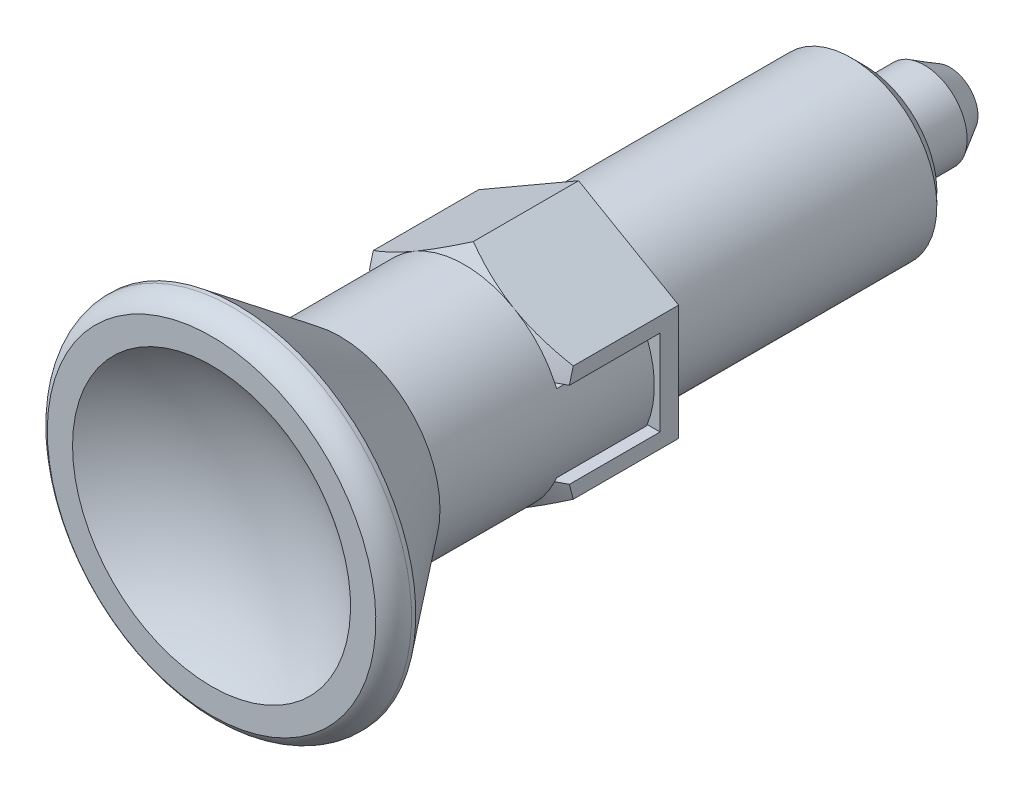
ISO-10303-21;
HEADER;
FILE_DESCRIPTION(('STEP AP214'),'2;1');
FILE_NAME('part.step','',(''),(''),'','','');
FILE_SCHEMA(('AUTOMOTIVE_DESIGN { 1 0 10303 214 1 1 1 1 }'));
ENDSEC;
DATA;
#1=APPLICATION_CONTEXT('core data for automotive mechanical design processes');
#2=APPLICATION_PROTOCOL_DEFINITION('international standard','automotive_design',2000,#1);
#3=PRODUCT_CONTEXT('',#1,'mechanical');
#4=PRODUCT('Part','Part','',(#3));
#5=PRODUCT_RELATED_PRODUCT_CATEGORY('part','',(#4));
#6=PRODUCT_DEFINITION_FORMATION('','',#4);
#7=PRODUCT_DEFINITION_CONTEXT('part definition',#1,'design');
#8=PRODUCT_DEFINITION('design','',#6,#7);
#9=PRODUCT_DEFINITION_SHAPE('','',#8);
#10=(LENGTH_UNIT() NAMED_UNIT(*) SI_UNIT(.MILLI.,.METRE.));
#11=(NAMED_UNIT(*) PLANE_ANGLE_UNIT() SI_UNIT($,.RADIAN.));
#12=(NAMED_UNIT(*) SI_UNIT($,.STERADIAN.) SOLID_ANGLE_UNIT());
#13=UNCERTAINTY_MEASURE_WITH_UNIT(LENGTH_MEASURE(1.E-05),#10,'distance_accuracy_value','');
#14=(GEOMETRIC_REPRESENTATION_CONTEXT(3) GLOBAL_UNCERTAINTY_ASSIGNED_CONTEXT((#13)) GLOBAL_UNIT_ASSIGNED_CONTEXT((#10,
#11,#12)) REPRESENTATION_CONTEXT('',''));
#15=CARTESIAN_POINT('',(0.,0.,0.));
#16=DIRECTION('',(0.,0.,1.));
#17=DIRECTION('',(1.,0.,0.));
#18=AXIS2_PLACEMENT_3D('',#15,#16,#17);
#19=CARTESIAN_POINT('',(7.,-4.0414518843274,0.));
#20=DIRECTION('',(1.,0.,0.));
#21=DIRECTION('',(0.,1.,0.));
#22=AXIS2_PLACEMENT_3D('',#19,#20,#21);
#23=PLANE('',#22);
#24=DIRECTION('',(0.,-1.,0.));
#25=VECTOR('',#24,1.);
#26=CARTESIAN_POINT('',(7.,0.,1.3));
#27=LINE('',#26,#25);
#28=CARTESIAN_POINT('',(7.,3.,1.3));
#29=VERTEX_POINT('',#28);
#30=CARTESIAN_POINT('',(7.,-3.,1.3));
#31=VERTEX_POINT('',#30);
#32=EDGE_CURVE('E504',#29,#31,#27,.T.);
#33=ORIENTED_EDGE('',*,*,#32,.T.);
#34=DIRECTION('',(0.,0.,1.));
#35=VECTOR('',#34,1.);
#36=CARTESIAN_POINT('',(7.,-3.,0.));
#37=LINE('',#36,#35);
#38=CARTESIAN_POINT('',(7.,-3.,7.64448323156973));
#39=VERTEX_POINT('',#38);
#40=EDGE_CURVE('E326',#31,#39,#37,.T.);
#41=ORIENTED_EDGE('',*,*,#40,.T.);
#42=CARTESIAN_POINT('',(7.,1.07878892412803,7.9522879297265));
#43=CARTESIAN_POINT('',(7.,0.902627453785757,7.96781186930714));
#44=CARTESIAN_POINT('',(7.,0.726129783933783,7.97959565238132));
#45=CARTESIAN_POINT('',(7.,0.372798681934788,7.99554139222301));
#46=CARTESIAN_POINT('',(7.,0.195965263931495,7.99970366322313));
#47=CARTESIAN_POINT('',(7.,-0.157349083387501,8.00026558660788));
#48=CARTESIAN_POINT('',(7.,-0.333829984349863,7.99668129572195));
#49=CARTESIAN_POINT('',(7.,-0.686466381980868,7.98188197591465));
#50=CARTESIAN_POINT('',(7.,-0.862621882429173,7.97066703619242));
#51=CARTESIAN_POINT('',(7.,-1.21180210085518,7.9410836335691));
#52=CARTESIAN_POINT('',(7.,-1.38483568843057,7.92281928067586));
#53=CARTESIAN_POINT('',(7.,-1.73006181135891,7.87953324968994));
#54=CARTESIAN_POINT('',(7.,-1.90225426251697,7.85451090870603));
#55=CARTESIAN_POINT('',(7.,-2.4173760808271,7.77002050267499));
#56=CARTESIAN_POINT('',(7.,-2.75878325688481,7.70113504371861));
#57=CARTESIAN_POINT('',(7.,-3.4331630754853,7.54359029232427));
#58=CARTESIAN_POINT('',(7.,-3.76618636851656,7.45514189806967));
#59=CARTESIAN_POINT('',(7.,-4.42757930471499,7.2622614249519));
#60=CARTESIAN_POINT('',(7.,-4.7559481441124,7.15782662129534));
#61=CARTESIAN_POINT('',(7.,-5.4133750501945,6.93482995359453));
#62=CARTESIAN_POINT('',(7.,-5.74236794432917,6.81607774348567));
#63=CARTESIAN_POINT('',(7.,-6.23284617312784,6.63056193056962));
#64=CARTESIAN_POINT('',(7.,-6.39575839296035,6.56752459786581));
#65=CARTESIAN_POINT('',(7.,-6.72070206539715,6.43925567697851));
#66=CARTESIAN_POINT('',(7.,-6.88273358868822,6.37402426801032));
#67=CARTESIAN_POINT('',(7.,-7.0443720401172,6.30783239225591));
#68=B_SPLINE_CURVE_WITH_KNOTS('',3,(#42,#43,#44,#45,#46,#47,#48,#49,#50,#51,#52,#53,#54,#55,#56,
#57,#58,#59,#60,#61,#62,#63,#64,#65,#66,#67),.UNSPECIFIED.,.F.,.F.,(4,2,2,2,2,2,2,2,2,2,2,2,4),
(0.,0.53050279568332,1.06098371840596,1.59036613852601,2.11974237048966,2.64158243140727,
3.16347369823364,4.20745648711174,5.24069021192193,6.27410024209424,7.32319389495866,
7.84723013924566,8.37122368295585),.UNSPECIFIED.);
#69=CARTESIAN_POINT('',(7.,-4.0414518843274,7.3747852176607));
#70=VERTEX_POINT('',#69);
#71=EDGE_CURVE('E509',#39,#70,#68,.T.);
#72=ORIENTED_EDGE('',*,*,#71,.T.);
#73=DIRECTION('',(0.,0.,1.));
#74=VECTOR('',#73,1.);
#75=CARTESIAN_POINT('',(7.,-4.0414518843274,0.));
#76=LINE('',#75,#74);
#77=CARTESIAN_POINT('',(7.,-4.0414518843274,0.));
#78=VERTEX_POINT('',#77);
#79=EDGE_CURVE('E43',#78,#70,#76,.T.);
#80=ORIENTED_EDGE('',*,*,#79,.F.);
#81=DIRECTION('',(0.,1.,0.));
#82=VECTOR('',#81,1.);
#83=CARTESIAN_POINT('',(7.,-4.0414518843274,0.));
#84=LINE('',#83,#82);
#85=CARTESIAN_POINT('',(7.,4.0414518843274,0.));
#86=VERTEX_POINT('',#85);
#87=EDGE_CURVE('E331',#78,#86,#84,.T.);
#88=ORIENTED_EDGE('',*,*,#87,.T.);
#89=DIRECTION('',(0.,0.,1.));
#90=VECTOR('',#89,1.);
#91=CARTESIAN_POINT('',(7.,4.0414518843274,0.));
#92=LINE('',#91,#90);
#93=CARTESIAN_POINT('',(7.,4.0414518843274,7.3747852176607));
#94=VERTEX_POINT('',#93);
#95=EDGE_CURVE('E341',#86,#94,#92,.T.);
#96=ORIENTED_EDGE('',*,*,#95,.T.);
#97=CARTESIAN_POINT('',(7.,7.64652177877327,6.05621183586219));
#98=CARTESIAN_POINT('',(7.,7.48622924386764,6.12446891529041));
#99=CARTESIAN_POINT('',(7.,7.32558748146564,6.19190511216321));
#100=CARTESIAN_POINT('',(7.,7.00352131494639,6.32490800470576));
#101=CARTESIAN_POINT('',(7.,6.84209686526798,6.39047458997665));
#102=CARTESIAN_POINT('',(7.,6.35635819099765,6.58409342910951));
#103=CARTESIAN_POINT('',(7.,6.03077000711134,6.70898264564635));
#104=CARTESIAN_POINT('',(7.,5.37954265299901,6.94646976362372));
#105=CARTESIAN_POINT('',(7.,5.05395108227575,7.05919729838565));
#106=CARTESIAN_POINT('',(7.,4.3983071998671,7.27101134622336));
#107=CARTESIAN_POINT('',(7.,4.06825488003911,7.37009783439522));
#108=CARTESIAN_POINT('',(7.,3.40026161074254,7.55167915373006));
#109=CARTESIAN_POINT('',(7.,3.06227586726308,7.63401136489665));
#110=CARTESIAN_POINT('',(7.,2.38170687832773,7.7763889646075));
#111=CARTESIAN_POINT('',(7.,2.03912642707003,7.83644731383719));
#112=CARTESIAN_POINT('',(7.,1.52058067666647,7.90690557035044));
#113=CARTESIAN_POINT('',(7.,1.34592938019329,7.9271792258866));
#114=CARTESIAN_POINT('',(7.,0.995934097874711,7.96051609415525));
#115=CARTESIAN_POINT('',(7.,0.820590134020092,7.97357953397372));
#116=CARTESIAN_POINT('',(7.,0.469090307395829,7.99219675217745));
#117=CARTESIAN_POINT('',(7.,0.292933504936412,7.99773285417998));
#118=CARTESIAN_POINT('',(7.,-0.0594848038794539,8.00114348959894));
#119=CARTESIAN_POINT('',(7.,-0.235746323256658,7.99901666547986));
#120=CARTESIAN_POINT('',(7.,-0.4118801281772,7.99300999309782));
#121=B_SPLINE_CURVE_WITH_KNOTS('',3,(#97,#98,#99,#100,#101,#102,#103,#104,#105,#106,#107,#108,
#109,#110,#111,#112,#113,#114,#115,#116,#117,#118,#119,#120),.UNSPECIFIED.,.F.,.F.,(4,2,2,2,2,2,
2,2,2,2,2,4),(0.,0.522656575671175,1.04534395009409,2.09134325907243,3.12477688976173,
4.15821240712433,5.20124472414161,6.24366916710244,6.77101510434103,7.29834443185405,
7.8269099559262,8.35556912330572),.UNSPECIFIED.);
#122=CARTESIAN_POINT('',(7.,3.,7.64448323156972));
#123=VERTEX_POINT('',#122);
#124=EDGE_CURVE('E600',#94,#123,#121,.T.);
#125=ORIENTED_EDGE('',*,*,#124,.T.);
#126=DIRECTION('',(0.,0.,-1.));
#127=VECTOR('',#126,1.);
#128=CARTESIAN_POINT('',(7.,3.,0.));
#129=LINE('',#128,#127);
#130=EDGE_CURVE('E299',#123,#29,#129,.T.);
#131=ORIENTED_EDGE('',*,*,#130,.T.);
#132=EDGE_LOOP('',(#33,#41,#72,#80,#88,#96,#125,#131));
#133=FACE_BOUND('',#132,.T.);
#134=ADVANCED_FACE('F14',(#133),#23,.T.);
#135=CARTESIAN_POINT('',(0.,0.,6.2679491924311));
#136=DIRECTION('',(0.,0.,-1.));
#137=DIRECTION('',(0.,1.,0.));
#138=AXIS2_PLACEMENT_3D('',#135,#136,#137);
#139=CONICAL_SURFACE('',#138,10.,1.0471975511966);
#140=CARTESIAN_POINT('',(12.3059150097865,3.,4.72855131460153));
#141=CARTESIAN_POINT('',(12.0776679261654,3.,4.85657815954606));
#142=CARTESIAN_POINT('',(11.8493374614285,3.,4.98445646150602));
#143=CARTESIAN_POINT('',(11.3924756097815,3.,5.23985340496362));
#144=CARTESIAN_POINT('',(11.1639442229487,3.,5.36737204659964));
#145=CARTESIAN_POINT('',(10.4782464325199,3.,5.74915598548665));
#146=CARTESIAN_POINT('',(10.0207276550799,3.,6.00278899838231));
#147=CARTESIAN_POINT('',(9.1054920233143,3.,6.50698094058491));
#148=CARTESIAN_POINT('',(8.64777854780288,3.,6.75754598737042));
#149=CARTESIAN_POINT('',(7.95954912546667,3.,7.13063803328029));
#150=CARTESIAN_POINT('',(7.72979884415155,3.,7.25457677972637));
#151=CARTESIAN_POINT('',(7.26964968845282,3.,7.50124355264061));
#152=CARTESIAN_POINT('',(7.03925081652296,3.,7.62397158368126));
#153=CARTESIAN_POINT('',(6.57652976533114,3.,7.86844363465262));
#154=CARTESIAN_POINT('',(6.34420364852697,3.,7.99018021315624));
#155=CARTESIAN_POINT('',(5.87848385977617,3.,8.23155125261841));
#156=CARTESIAN_POINT('',(5.64509027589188,3.,8.35118588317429));
#157=CARTESIAN_POINT('',(5.17718822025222,3.,8.58744950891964));
#158=CARTESIAN_POINT('',(4.94268174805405,3.,8.70408244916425));
#159=CARTESIAN_POINT('',(4.47165682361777,3.,8.93341544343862));
#160=CARTESIAN_POINT('',(4.23513776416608,3.,9.04611425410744));
#161=CARTESIAN_POINT('',(3.75830999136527,3.,9.26631277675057));
#162=CARTESIAN_POINT('',(3.51798869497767,3.,9.37378557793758));
#163=CARTESIAN_POINT('',(3.15480910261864,3.,9.52840473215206));
#164=CARTESIAN_POINT('',(3.03334785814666,3.,9.57882759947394));
#165=CARTESIAN_POINT('',(2.7893314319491,3.,9.67694471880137));
#166=CARTESIAN_POINT('',(2.66677631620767,3.,9.72463913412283));
#167=CARTESIAN_POINT('',(2.41976783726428,3.,9.81686502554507));
#168=CARTESIAN_POINT('',(2.29530801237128,3.,9.86137930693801));
#169=CARTESIAN_POINT('',(2.0449573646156,3.,9.94609452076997));
#170=CARTESIAN_POINT('',(1.9190669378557,3.,9.98629661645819));
#171=CARTESIAN_POINT('',(1.66528919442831,3.,10.0614446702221));
#172=CARTESIAN_POINT('',(1.53739701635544,3.,10.0963744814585));
#173=CARTESIAN_POINT('',(1.27985720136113,3.,10.1595669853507));
#174=CARTESIAN_POINT('',(1.15020799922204,3.,10.1878232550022));
#175=CARTESIAN_POINT('',(1.01973820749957,3.,10.2120743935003));
#176=B_SPLINE_CURVE_WITH_KNOTS('',3,(#140,#141,#142,#143,#144,#145,#146,#147,#148,#149,#150,
#151,#152,#153,#154,#155,#156,#157,#158,#159,#160,#161,#162,#163,#164,#165,#166,#167,#168,#169,
#170,#171,#172,#173,#174,#175),.UNSPECIFIED.,.F.,.F.,(4,2,2,2,2,2,2,2,2,2,2,2,2,2,2,2,2,4),(0.,
0.78510408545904,1.57020786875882,3.1395595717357,4.70497268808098,5.48811368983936,
6.2712517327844,7.05810907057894,7.84490262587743,8.63060301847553,9.41654951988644,
10.2061881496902,10.6006977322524,10.9951836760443,11.3916623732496,11.7880338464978,
12.1855956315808,12.5835385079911),.UNSPECIFIED.);
#177=CARTESIAN_POINT('',(6.32455532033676,3.,8.));
#178=VERTEX_POINT('',#177);
#179=EDGE_CURVE('E292',#123,#178,#176,.T.);
#180=ORIENTED_EDGE('',*,*,#179,.F.);
#181=ORIENTED_EDGE('',*,*,#124,.F.);
#182=CARTESIAN_POINT('',(-0.00020000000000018,8.08301923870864,7.37471854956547));
#183=CARTESIAN_POINT('',(0.153667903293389,7.99418356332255,7.42600015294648));
#184=CARTESIAN_POINT('',(0.308109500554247,7.90501666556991,7.47495440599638));
#185=CARTESIAN_POINT('',(0.618246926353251,7.72595873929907,7.56756721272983));
#186=CARTESIAN_POINT('',(0.773943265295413,7.63606741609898,7.6112234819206));
#187=CARTESIAN_POINT('',(1.24352516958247,7.36495417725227,7.73338840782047));
#188=CARTESIAN_POINT('',(1.55926433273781,7.18266208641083,7.80287444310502));
#189=CARTESIAN_POINT('',(2.03176224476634,6.90986528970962,7.88435504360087));
#190=CARTESIAN_POINT('',(2.1871092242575,6.8201756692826,7.9075665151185));
#191=CARTESIAN_POINT('',(2.49850511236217,6.64039116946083,7.94648878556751));
#192=CARTESIAN_POINT('',(2.65455395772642,6.55029632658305,7.96220024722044));
#193=CARTESIAN_POINT('',(2.96692267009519,6.36995016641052,7.98572208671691));
#194=CARTESIAN_POINT('',(3.12324202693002,6.27969914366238,7.9935414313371));
#195=CARTESIAN_POINT('',(3.43601650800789,6.09911871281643,8.00111975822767));
#196=CARTESIAN_POINT('',(3.59247162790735,6.00878930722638,8.000878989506));
#197=CARTESIAN_POINT('',(4.02110687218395,5.76131663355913,7.9891402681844));
#198=CARTESIAN_POINT('',(4.29314668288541,5.60425437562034,7.96943425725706));
#199=CARTESIAN_POINT('',(4.8354194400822,5.29117305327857,7.90694653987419));
#200=CARTESIAN_POINT('',(5.10565047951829,5.13515508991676,7.86414347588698));
#201=CARTESIAN_POINT('',(5.64901454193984,4.8214437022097,7.75714832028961));
#202=CARTESIAN_POINT('',(5.92207900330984,4.66378986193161,7.6925029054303));
#203=CARTESIAN_POINT('',(6.46413578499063,4.35083323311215,7.54578392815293));
#204=CARTESIAN_POINT('',(6.73313504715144,4.19552643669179,7.46374482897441));
#205=CARTESIAN_POINT('',(7.0002,4.04133641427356,7.37471854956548));
#206=B_SPLINE_CURVE_WITH_KNOTS('',3,(#182,#183,#184,#185,#186,#187,#188,#189,#190,#191,#192,
#193,#194,#195,#196,#197,#198,#199,#200,#201,#202,#203,#204,#205),.UNSPECIFIED.,.F.,.F.,(4,2,2,
2,2,2,2,2,2,2,2,4),(0.,0.554727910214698,1.1096941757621,2.22193274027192,2.76443041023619,
3.3068801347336,3.84871284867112,4.39052882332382,5.33376515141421,6.27787517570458,
7.24292418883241,8.20607866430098),.UNSPECIFIED.);
#207=CARTESIAN_POINT('',(3.5,6.06217782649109,8.));
#208=VERTEX_POINT('',#207);
#209=EDGE_CURVE('E456',#208,#94,#206,.T.);
#210=ORIENTED_EDGE('',*,*,#209,.F.);
#211=CARTESIAN_POINT('',(0.,0.,8.));
#212=DIRECTION('',(0.,0.,1.));
#213=DIRECTION('',(0.,-1.,0.));
#214=AXIS2_PLACEMENT_3D('',#211,#212,#213);
#215=CIRCLE('',#214,7.);
#216=EDGE_CURVE('E421',#178,#208,#215,.T.);
#217=ORIENTED_EDGE('',*,*,#216,.F.);
#218=EDGE_LOOP('',(#180,#181,#210,#217));
#219=FACE_BOUND('',#218,.T.);
#220=ADVANCED_FACE('F497',(#219),#139,.T.);
#221=CARTESIAN_POINT('',(0.835705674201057,-3.,10.2434526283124));
#222=CARTESIAN_POINT('',(0.954556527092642,-3.,10.2250468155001));
#223=CARTESIAN_POINT('',(1.0727966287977,-3.,10.2030713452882));
#224=CARTESIAN_POINT('',(1.30787414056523,-3.,10.1530110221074));
#225=CARTESIAN_POINT('',(1.42471271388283,-3.,10.1249316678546));
#226=CARTESIAN_POINT('',(1.65664088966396,-3.,10.0637567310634));
#227=CARTESIAN_POINT('',(1.77173495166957,-3.,10.0306777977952));
#228=CARTESIAN_POINT('',(2.00065560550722,-3.,9.96032622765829));
#229=CARTESIAN_POINT('',(2.11448187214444,-3.,9.92305254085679));
#230=CARTESIAN_POINT('',(2.45284050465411,-3.,9.80660704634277));
#231=CARTESIAN_POINT('',(2.67564332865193,-3.,9.72242336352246));
#232=CARTESIAN_POINT('',(3.11782175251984,-3.,9.54508018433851));
#233=CARTESIAN_POINT('',(3.33719374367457,-3.,9.45191189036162));
#234=CARTESIAN_POINT('',(3.82213454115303,-3.,9.23794205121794));
#235=CARTESIAN_POINT('',(4.08703255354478,-3.,9.11562863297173));
#236=CARTESIAN_POINT('',(4.61392551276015,-3.,8.86518065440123));
#237=CARTESIAN_POINT('',(4.87592138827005,-3.,8.73704802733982));
#238=CARTESIAN_POINT('',(5.39886826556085,-3.,8.47632634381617));
#239=CARTESIAN_POINT('',(5.65981201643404,-3.,8.34372279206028));
#240=CARTESIAN_POINT('',(6.18026478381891,-3.,8.07568702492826));
#241=CARTESIAN_POINT('',(6.43977368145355,-3.,7.94025457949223));
#242=CARTESIAN_POINT('',(6.93280676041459,-3.,7.68046272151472));
#243=CARTESIAN_POINT('',(7.16642995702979,-3.,7.55629087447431));
#244=CARTESIAN_POINT('',(7.63298674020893,-3.,7.30665746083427));
#245=CARTESIAN_POINT('',(7.86592032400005,-3.,7.18119588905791));
#246=CARTESIAN_POINT('',(8.56390398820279,-3.,6.80331857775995));
#247=CARTESIAN_POINT('',(9.02814365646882,-3.,6.54940670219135));
#248=CARTESIAN_POINT('',(9.95167326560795,-3.,6.04098578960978));
#249=CARTESIAN_POINT('',(10.4109739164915,-3.,5.78649615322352));
#250=CARTESIAN_POINT('',(11.0991952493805,-3.,5.4034691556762));
#251=CARTESIAN_POINT('',(11.3284770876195,-3.,5.27558012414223));
#252=CARTESIAN_POINT('',(11.7868347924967,-3.,5.01943471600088));
#253=CARTESIAN_POINT('',(12.0159106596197,-3.,4.89117834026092));
#254=CARTESIAN_POINT('',(12.2449014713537,-3.,4.76277040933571));
#255=B_SPLINE_CURVE_WITH_KNOTS('',3,(#221,#222,#223,#224,#225,#226,#227,#228,#229,#230,#231,
#232,#233,#234,#235,#236,#237,#238,#239,#240,#241,#242,#243,#244,#245,#246,#247,#248,#249,#250,
#251,#252,#253,#254),.UNSPECIFIED.,.F.,.F.,(4,2,2,2,2,2,2,2,2,2,2,2,2,2,2,2,4),(0.,
0.360665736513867,0.721007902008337,1.08017549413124,1.43943318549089,2.15362596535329,
2.868525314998,3.74372217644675,4.61863037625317,5.49671619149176,6.37487369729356,
7.16858529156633,7.96230007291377,9.54970696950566,11.1249798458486,11.9125910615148,
12.7002004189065),.UNSPECIFIED.);
#256=CARTESIAN_POINT('',(6.32455532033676,-3.,8.));
#257=VERTEX_POINT('',#256);
#258=EDGE_CURVE('E320',#257,#39,#255,.T.);
#259=ORIENTED_EDGE('',*,*,#258,.F.);
#260=CARTESIAN_POINT('',(3.5,-6.06217782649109,8.));
#261=VERTEX_POINT('',#260);
#262=EDGE_CURVE('E552',#261,#257,#215,.T.);
#263=ORIENTED_EDGE('',*,*,#262,.F.);
#264=CARTESIAN_POINT('',(7.0002,-4.04133641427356,7.37471854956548));
#265=CARTESIAN_POINT('',(6.84633209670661,-4.13017208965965,7.42600015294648));
#266=CARTESIAN_POINT('',(6.69189049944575,-4.21933898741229,7.47495440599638));
#267=CARTESIAN_POINT('',(6.38175307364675,-4.39839691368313,7.56756721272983));
#268=CARTESIAN_POINT('',(6.22605673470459,-4.48828823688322,7.6112234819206));
#269=CARTESIAN_POINT('',(5.75647483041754,-4.75940147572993,7.73338840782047));
#270=CARTESIAN_POINT('',(5.4407356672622,-4.94169356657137,7.80287444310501));
#271=CARTESIAN_POINT('',(4.96823775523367,-5.21449036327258,7.88435504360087));
#272=CARTESIAN_POINT('',(4.81289077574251,-5.30417998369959,7.90756651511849));
#273=CARTESIAN_POINT('',(4.50149488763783,-5.48396448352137,7.9464887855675));
#274=CARTESIAN_POINT('',(4.34544604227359,-5.57405932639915,7.96220024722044));
#275=CARTESIAN_POINT('',(4.03307732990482,-5.75440548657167,7.9857220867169));
#276=CARTESIAN_POINT('',(3.87675797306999,-5.84465650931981,7.9935414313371));
#277=CARTESIAN_POINT('',(3.56398349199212,-6.02523694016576,8.00111975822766));
#278=CARTESIAN_POINT('',(3.40752837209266,-6.11556634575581,8.00087898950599));
#279=CARTESIAN_POINT('',(2.97889312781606,-6.36303901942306,7.98914026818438));
#280=CARTESIAN_POINT('',(2.7068533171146,-6.52010127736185,7.96943425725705));
#281=CARTESIAN_POINT('',(2.1645805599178,-6.83318259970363,7.90694653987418));
#282=CARTESIAN_POINT('',(1.89434952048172,-6.98920056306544,7.86414347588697));
#283=CARTESIAN_POINT('',(1.35098545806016,-7.3029119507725,7.7571483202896));
#284=CARTESIAN_POINT('',(1.07792099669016,-7.46056579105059,7.69250290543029));
#285=CARTESIAN_POINT('',(0.53586421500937,-7.77352241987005,7.54578392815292));
#286=CARTESIAN_POINT('',(0.266864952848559,-7.92882921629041,7.46374482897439));
#287=CARTESIAN_POINT('',(-0.000200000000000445,-8.08301923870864,7.37471854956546));
#288=B_SPLINE_CURVE_WITH_KNOTS('',3,(#264,#265,#266,#267,#268,#269,#270,#271,#272,#273,#274,
#275,#276,#277,#278,#279,#280,#281,#282,#283,#284,#285,#286,#287),.UNSPECIFIED.,.F.,.F.,(4,2,2,
2,2,2,2,2,2,2,2,4),(0.,0.554727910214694,1.10969417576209,2.22193274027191,2.76443041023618,
3.30688013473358,3.84871284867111,4.3905288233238,5.3337651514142,6.27787517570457,
7.24292418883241,8.20607866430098),.UNSPECIFIED.);
#289=EDGE_CURVE('E398',#70,#261,#288,.T.);
#290=ORIENTED_EDGE('',*,*,#289,.F.);
#291=ORIENTED_EDGE('',*,*,#71,.F.);
#292=EDGE_LOOP('',(#259,#263,#290,#291));
#293=FACE_BOUND('',#292,.T.);
#294=ADVANCED_FACE('F492',(#293),#139,.T.);
#295=CARTESIAN_POINT('',(0.,0.,-26.));
#296=DIRECTION('',(0.,0.,1.));
#297=DIRECTION('',(0.,-1.,0.));
#298=AXIS2_PLACEMENT_3D('',#295,#296,#297);
#299=CYLINDRICAL_SURFACE('',#298,7.);
#300=CARTESIAN_POINT('',(0.,0.,1.7));
#301=DIRECTION('',(0.,0.,1.));
#302=DIRECTION('',(0.,-1.,0.));
#303=AXIS2_PLACEMENT_3D('',#300,#301,#302);
#304=CIRCLE('',#303,7.);
#305=CARTESIAN_POINT('',(-6.458327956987,-2.7,1.7));
#306=VERTEX_POINT('',#305);
#307=CARTESIAN_POINT('',(-6.458327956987,2.7,1.7));
#308=VERTEX_POINT('',#307);
#309=EDGE_CURVE('E242',#306,#308,#304,.F.);
#310=ORIENTED_EDGE('',*,*,#309,.F.);
#311=DIRECTION('',(0.,0.,1.));
#312=VECTOR('',#311,1.);
#313=CARTESIAN_POINT('',(-6.458327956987,-2.7,1.3));
#314=LINE('',#313,#312);
#315=CARTESIAN_POINT('',(-6.45832795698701,-2.7,8.));
#316=VERTEX_POINT('',#315);
#317=EDGE_CURVE('E408',#306,#316,#314,.T.);
#318=ORIENTED_EDGE('',*,*,#317,.T.);
#319=CARTESIAN_POINT('',(-6.32455532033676,-3.,8.));
#320=VERTEX_POINT('',#319);
#321=EDGE_CURVE('E423',#316,#320,#215,.T.);
#322=ORIENTED_EDGE('',*,*,#321,.T.);
#323=CARTESIAN_POINT('',(-3.5,-6.06217782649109,8.));
#324=VERTEX_POINT('',#323);
#325=EDGE_CURVE('E422',#320,#324,#215,.T.);
#326=ORIENTED_EDGE('',*,*,#325,.T.);
#327=EDGE_CURVE('E553',#324,#261,#215,.T.);
#328=ORIENTED_EDGE('',*,*,#327,.T.);
#329=ORIENTED_EDGE('',*,*,#262,.T.);
#330=CARTESIAN_POINT('',(6.45832795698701,-2.7,8.));
#331=VERTEX_POINT('',#330);
#332=EDGE_CURVE('E416',#257,#331,#215,.T.);
#333=ORIENTED_EDGE('',*,*,#332,.T.);
#334=DIRECTION('',(0.,0.,1.));
#335=VECTOR('',#334,1.);
#336=CARTESIAN_POINT('',(6.458327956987,-2.7,1.3));
#337=LINE('',#336,#335);
#338=CARTESIAN_POINT('',(6.458327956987,-2.7,1.7));
#339=VERTEX_POINT('',#338);
#340=EDGE_CURVE('E411',#339,#331,#337,.T.);
#341=ORIENTED_EDGE('',*,*,#340,.F.);
#342=CARTESIAN_POINT('',(0.,0.,1.7));
#343=DIRECTION('',(0.,0.,-1.));
#344=DIRECTION('',(0.,1.,0.));
#345=AXIS2_PLACEMENT_3D('',#342,#343,#344);
#346=CIRCLE('',#345,7.);
#347=CARTESIAN_POINT('',(6.45832795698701,2.7,1.7));
#348=VERTEX_POINT('',#347);
#349=EDGE_CURVE('E536',#339,#348,#346,.F.);
#350=ORIENTED_EDGE('',*,*,#349,.T.);
#351=DIRECTION('',(0.,0.,1.));
#352=VECTOR('',#351,1.);
#353=CARTESIAN_POINT('',(6.458327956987,2.7,1.3));
#354=LINE('',#353,#352);
#355=CARTESIAN_POINT('',(6.45832795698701,2.7,8.));
#356=VERTEX_POINT('',#355);
#357=EDGE_CURVE('E413',#348,#356,#354,.T.);
#358=ORIENTED_EDGE('',*,*,#357,.T.);
#359=EDGE_CURVE('E417',#356,#178,#215,.T.);
#360=ORIENTED_EDGE('',*,*,#359,.T.);
#361=ORIENTED_EDGE('',*,*,#216,.T.);
#362=CARTESIAN_POINT('',(-3.5,6.06217782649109,8.));
#363=VERTEX_POINT('',#362);
#364=EDGE_CURVE('E529',#208,#363,#215,.T.);
#365=ORIENTED_EDGE('',*,*,#364,.T.);
#366=CARTESIAN_POINT('',(-6.32455532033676,3.,8.));
#367=VERTEX_POINT('',#366);
#368=EDGE_CURVE('E554',#363,#367,#215,.T.);
#369=ORIENTED_EDGE('',*,*,#368,.T.);
#370=CARTESIAN_POINT('',(-6.458327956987,2.7,8.));
#371=VERTEX_POINT('',#370);
#372=EDGE_CURVE('E530',#367,#371,#215,.T.);
#373=ORIENTED_EDGE('',*,*,#372,.T.);
#374=DIRECTION('',(0.,0.,1.));
#375=VECTOR('',#374,1.);
#376=CARTESIAN_POINT('',(-6.458327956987,2.7,1.3));
#377=LINE('',#376,#375);
#378=EDGE_CURVE('E405',#308,#371,#377,.T.);
#379=ORIENTED_EDGE('',*,*,#378,.F.);
#380=EDGE_LOOP('',(#310,#318,#322,#326,#328,#329,#333,#341,#350,#358,#360,#361,#365,#369,#373,#379));
#381=FACE_BOUND('',#380,.T.);
#382=CARTESIAN_POINT('',(0.,0.,16.7062986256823));
#383=DIRECTION('',(0.,0.,1.));
#384=DIRECTION('',(0.,-1.,0.));
#385=AXIS2_PLACEMENT_3D('',#382,#383,#384);
#386=CIRCLE('',#385,7.);
#387=CARTESIAN_POINT('',(0.,-7.,16.7062986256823));
#388=VERTEX_POINT('',#387);
#389=EDGE_CURVE('E441',#388,#388,#386,.T.);
#390=ORIENTED_EDGE('',*,*,#389,.F.);
#391=EDGE_LOOP('',(#390));
#392=FACE_BOUND('',#391,.T.);
#393=ADVANCED_FACE('F532',(#381,#392),#299,.T.);
#394=CARTESIAN_POINT('',(6.,0.,0.));
#395=DIRECTION('',(0.,0.,1.));
#396=DIRECTION('',(0.,-1.,0.));
#397=AXIS2_PLACEMENT_3D('',#394,#395,#396);
#398=PLANE('',#397);
#399=CARTESIAN_POINT('',(0.,0.,0.));
#400=DIRECTION('',(0.,0.,1.));
#401=DIRECTION('',(0.,-1.,0.));
#402=AXIS2_PLACEMENT_3D('',#399,#400,#401);
#403=CIRCLE('',#402,6.);
#404=CARTESIAN_POINT('',(0.,-6.,0.));
#405=VERTEX_POINT('',#404);
#406=EDGE_CURVE('E420',#405,#405,#403,.T.);
#407=ORIENTED_EDGE('',*,*,#406,.T.);
#408=EDGE_LOOP('',(#407));
#409=FACE_BOUND('',#408,.T.);
#410=DIRECTION('',(-0.866025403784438,0.5,0.));
#411=VECTOR('',#410,1.);
#412=CARTESIAN_POINT('',(7.,4.0414518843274,0.));
#413=LINE('',#412,#411);
#414=CARTESIAN_POINT('',(0.,8.0829037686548,0.));
#415=VERTEX_POINT('',#414);
#416=EDGE_CURVE('E329',#86,#415,#413,.T.);
#417=ORIENTED_EDGE('',*,*,#416,.F.);
#418=ORIENTED_EDGE('',*,*,#87,.F.);
#419=DIRECTION('',(0.866025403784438,0.5,0.));
#420=VECTOR('',#419,1.);
#421=CARTESIAN_POINT('',(0.,-8.0829037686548,0.));
#422=LINE('',#421,#420);
#423=CARTESIAN_POINT('',(0.,-8.0829037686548,0.));
#424=VERTEX_POINT('',#423);
#425=EDGE_CURVE('E333',#424,#78,#422,.T.);
#426=ORIENTED_EDGE('',*,*,#425,.F.);
#427=DIRECTION('',(0.866025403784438,-0.5,0.));
#428=VECTOR('',#427,1.);
#429=CARTESIAN_POINT('',(-7.,-4.0414518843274,0.));
#430=LINE('',#429,#428);
#431=CARTESIAN_POINT('',(-7.,-4.0414518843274,0.));
#432=VERTEX_POINT('',#431);
#433=EDGE_CURVE('E335',#432,#424,#430,.T.);
#434=ORIENTED_EDGE('',*,*,#433,.F.);
#435=DIRECTION('',(0.,-1.,0.));
#436=VECTOR('',#435,1.);
#437=CARTESIAN_POINT('',(-7.,4.0414518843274,0.));
#438=LINE('',#437,#436);
#439=CARTESIAN_POINT('',(-7.,4.0414518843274,0.));
#440=VERTEX_POINT('',#439);
#441=EDGE_CURVE('E337',#440,#432,#438,.T.);
#442=ORIENTED_EDGE('',*,*,#441,.F.);
#443=DIRECTION('',(-0.866025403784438,-0.5,0.));
#444=VECTOR('',#443,1.);
#445=CARTESIAN_POINT('',(0.,8.0829037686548,0.));
#446=LINE('',#445,#444);
#447=EDGE_CURVE('E339',#415,#440,#446,.T.);
#448=ORIENTED_EDGE('',*,*,#447,.F.);
#449=EDGE_LOOP('',(#417,#418,#426,#434,#442,#448));
#450=FACE_BOUND('',#449,.T.);
#451=ADVANCED_FACE('F385',(#409,#450),#398,.F.);
#452=CARTESIAN_POINT('',(-7.,-4.0414518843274,0.));
#453=DIRECTION('',(-0.5,-0.866025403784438,0.));
#454=DIRECTION('',(0.866025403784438,-0.5,0.));
#455=AXIS2_PLACEMENT_3D('',#452,#453,#454);
#456=PLANE('',#455);
#457=CARTESIAN_POINT('',(0.00020000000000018,-8.08301923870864,7.37471854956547));
#458=CARTESIAN_POINT('',(-0.153667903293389,-7.99418356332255,7.42600015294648));
#459=CARTESIAN_POINT('',(-0.308109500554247,-7.90501666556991,7.47495440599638));
#460=CARTESIAN_POINT('',(-0.618246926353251,-7.72595873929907,7.56756721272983));
#461=CARTESIAN_POINT('',(-0.773943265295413,-7.63606741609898,7.6112234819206));
#462=CARTESIAN_POINT('',(-1.24352516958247,-7.36495417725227,7.73338840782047));
#463=CARTESIAN_POINT('',(-1.55926433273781,-7.18266208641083,7.80287444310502));
#464=CARTESIAN_POINT('',(-2.03176224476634,-6.90986528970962,7.88435504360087));
#465=CARTESIAN_POINT('',(-2.1871092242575,-6.8201756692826,7.9075665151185));
#466=CARTESIAN_POINT('',(-2.49850511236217,-6.64039116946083,7.94648878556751));
#467=CARTESIAN_POINT('',(-2.65455395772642,-6.55029632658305,7.96220024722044));
#468=CARTESIAN_POINT('',(-2.96692267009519,-6.36995016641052,7.98572208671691));
#469=CARTESIAN_POINT('',(-3.12324202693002,-6.27969914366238,7.9935414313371));
#470=CARTESIAN_POINT('',(-3.43601650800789,-6.09911871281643,8.00111975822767));
#471=CARTESIAN_POINT('',(-3.59247162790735,-6.00878930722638,8.000878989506));
#472=CARTESIAN_POINT('',(-4.02110687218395,-5.76131663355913,7.9891402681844));
#473=CARTESIAN_POINT('',(-4.29314668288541,-5.60425437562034,7.96943425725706));
#474=CARTESIAN_POINT('',(-4.8354194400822,-5.29117305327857,7.90694653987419));
#475=CARTESIAN_POINT('',(-5.10565047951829,-5.13515508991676,7.86414347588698));
#476=CARTESIAN_POINT('',(-5.64901454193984,-4.8214437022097,7.75714832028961));
#477=CARTESIAN_POINT('',(-5.92207900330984,-4.66378986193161,7.6925029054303));
#478=CARTESIAN_POINT('',(-6.46413578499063,-4.35083323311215,7.54578392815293));
#479=CARTESIAN_POINT('',(-6.73313504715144,-4.19552643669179,7.46374482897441));
#480=CARTESIAN_POINT('',(-7.0002,-4.04133641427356,7.37471854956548));
#481=B_SPLINE_CURVE_WITH_KNOTS('',3,(#457,#458,#459,#460,#461,#462,#463,#464,#465,#466,#467,
#468,#469,#470,#471,#472,#473,#474,#475,#476,#477,#478,#479,#480),.UNSPECIFIED.,.F.,.F.,(4,2,2,
2,2,2,2,2,2,2,2,4),(0.,0.554727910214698,1.1096941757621,2.22193274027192,2.76443041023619,
3.3068801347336,3.84871284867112,4.39052882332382,5.33376515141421,6.27787517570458,
7.24292418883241,8.20607866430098),.UNSPECIFIED.);
#482=CARTESIAN_POINT('',(0.,-8.0829037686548,7.37478521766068));
#483=VERTEX_POINT('',#482);
#484=EDGE_CURVE('E397',#483,#324,#481,.T.);
#485=ORIENTED_EDGE('',*,*,#484,.T.);
#486=CARTESIAN_POINT('',(-7.,-4.0414518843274,7.3747852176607));
#487=VERTEX_POINT('',#486);
#488=EDGE_CURVE('E390',#324,#487,#481,.T.);
#489=ORIENTED_EDGE('',*,*,#488,.T.);
#490=DIRECTION('',(0.,0.,1.));
#491=VECTOR('',#490,1.);
#492=CARTESIAN_POINT('',(-7.,-4.0414518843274,0.));
#493=LINE('',#492,#491);
#494=EDGE_CURVE('E346',#432,#487,#493,.T.);
#495=ORIENTED_EDGE('',*,*,#494,.F.);
#496=ORIENTED_EDGE('',*,*,#433,.T.);
#497=DIRECTION('',(0.,0.,1.));
#498=VECTOR('',#497,1.);
#499=CARTESIAN_POINT('',(0.,-8.0829037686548,0.));
#500=LINE('',#499,#498);
#501=EDGE_CURVE('E349',#424,#483,#500,.T.);
#502=ORIENTED_EDGE('',*,*,#501,.T.);
#503=EDGE_LOOP('',(#485,#489,#495,#496,#502));
#504=FACE_BOUND('',#503,.T.);
#505=ADVANCED_FACE('F379',(#504),#456,.T.);
#506=CARTESIAN_POINT('',(0.,-8.0829037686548,0.));
#507=DIRECTION('',(0.5,-0.866025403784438,0.));
#508=DIRECTION('',(0.866025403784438,0.5,0.));
#509=AXIS2_PLACEMENT_3D('',#506,#507,#508);
#510=PLANE('',#509);
#511=ORIENTED_EDGE('',*,*,#289,.T.);
#512=EDGE_CURVE('E399',#261,#483,#288,.T.);
#513=ORIENTED_EDGE('',*,*,#512,.T.);
#514=ORIENTED_EDGE('',*,*,#501,.F.);
#515=ORIENTED_EDGE('',*,*,#425,.T.);
#516=ORIENTED_EDGE('',*,*,#79,.T.);
#517=EDGE_LOOP('',(#511,#513,#514,#515,#516));
#518=FACE_BOUND('',#517,.T.);
#519=ADVANCED_FACE('F384',(#518),#510,.T.);
#520=CARTESIAN_POINT('',(7.,4.0414518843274,0.));
#521=DIRECTION('',(0.5,0.866025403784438,0.));
#522=DIRECTION('',(-0.866025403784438,0.5,0.));
#523=AXIS2_PLACEMENT_3D('',#520,#521,#522);
#524=PLANE('',#523);
#525=CARTESIAN_POINT('',(0.,8.0829037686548,7.37478521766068));
#526=VERTEX_POINT('',#525);
#527=EDGE_CURVE('E463',#526,#208,#206,.T.);
#528=ORIENTED_EDGE('',*,*,#527,.T.);
#529=ORIENTED_EDGE('',*,*,#209,.T.);
#530=ORIENTED_EDGE('',*,*,#95,.F.);
#531=ORIENTED_EDGE('',*,*,#416,.T.);
#532=DIRECTION('',(0.,0.,1.));
#533=VECTOR('',#532,1.);
#534=CARTESIAN_POINT('',(0.,8.0829037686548,0.));
#535=LINE('',#534,#533);
#536=EDGE_CURVE('E345',#415,#526,#535,.T.);
#537=ORIENTED_EDGE('',*,*,#536,.T.);
#538=EDGE_LOOP('',(#528,#529,#530,#531,#537));
#539=FACE_BOUND('',#538,.T.);
#540=ADVANCED_FACE('F470',(#539),#524,.T.);
#541=CARTESIAN_POINT('',(0.,8.0829037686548,0.));
#542=DIRECTION('',(-0.5,0.866025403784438,0.));
#543=DIRECTION('',(-0.866025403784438,-0.5,0.));
#544=AXIS2_PLACEMENT_3D('',#541,#542,#543);
#545=PLANE('',#544);
#546=CARTESIAN_POINT('',(-7.0002,4.04133641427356,7.37471854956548));
#547=CARTESIAN_POINT('',(-6.84633209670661,4.13017208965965,7.42600015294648));
#548=CARTESIAN_POINT('',(-6.69189049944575,4.21933898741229,7.47495440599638));
#549=CARTESIAN_POINT('',(-6.38175307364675,4.39839691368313,7.56756721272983));
#550=CARTESIAN_POINT('',(-6.22605673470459,4.48828823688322,7.6112234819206));
#551=CARTESIAN_POINT('',(-5.75647483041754,4.75940147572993,7.73338840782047));
#552=CARTESIAN_POINT('',(-5.4407356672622,4.94169356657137,7.80287444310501));
#553=CARTESIAN_POINT('',(-4.96823775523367,5.21449036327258,7.88435504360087));
#554=CARTESIAN_POINT('',(-4.81289077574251,5.30417998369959,7.90756651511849));
#555=CARTESIAN_POINT('',(-4.50149488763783,5.48396448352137,7.9464887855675));
#556=CARTESIAN_POINT('',(-4.34544604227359,5.57405932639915,7.96220024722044));
#557=CARTESIAN_POINT('',(-4.03307732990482,5.75440548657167,7.9857220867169));
#558=CARTESIAN_POINT('',(-3.87675797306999,5.84465650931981,7.9935414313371));
#559=CARTESIAN_POINT('',(-3.56398349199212,6.02523694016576,8.00111975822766));
#560=CARTESIAN_POINT('',(-3.40752837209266,6.11556634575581,8.00087898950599));
#561=CARTESIAN_POINT('',(-2.97889312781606,6.36303901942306,7.98914026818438));
#562=CARTESIAN_POINT('',(-2.7068533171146,6.52010127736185,7.96943425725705));
#563=CARTESIAN_POINT('',(-2.1645805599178,6.83318259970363,7.90694653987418));
#564=CARTESIAN_POINT('',(-1.89434952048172,6.98920056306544,7.86414347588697));
#565=CARTESIAN_POINT('',(-1.35098545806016,7.3029119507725,7.7571483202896));
#566=CARTESIAN_POINT('',(-1.07792099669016,7.46056579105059,7.69250290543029));
#567=CARTESIAN_POINT('',(-0.53586421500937,7.77352241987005,7.54578392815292));
#568=CARTESIAN_POINT('',(-0.266864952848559,7.92882921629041,7.46374482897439));
#569=CARTESIAN_POINT('',(0.000200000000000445,8.08301923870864,7.37471854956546));
#570=B_SPLINE_CURVE_WITH_KNOTS('',3,(#546,#547,#548,#549,#550,#551,#552,#553,#554,#555,#556,
#557,#558,#559,#560,#561,#562,#563,#564,#565,#566,#567,#568,#569),.UNSPECIFIED.,.F.,.F.,(4,2,2,
2,2,2,2,2,2,2,2,4),(0.,0.554727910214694,1.10969417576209,2.22193274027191,2.76443041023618,
3.30688013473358,3.84871284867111,4.3905288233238,5.3337651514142,6.27787517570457,
7.24292418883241,8.20607866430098),.UNSPECIFIED.);
#571=CARTESIAN_POINT('',(-7.,4.0414518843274,7.3747852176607));
#572=VERTEX_POINT('',#571);
#573=EDGE_CURVE('E627',#572,#363,#570,.T.);
#574=ORIENTED_EDGE('',*,*,#573,.T.);
#575=EDGE_CURVE('E464',#363,#526,#570,.T.);
#576=ORIENTED_EDGE('',*,*,#575,.T.);
#577=ORIENTED_EDGE('',*,*,#536,.F.);
#578=ORIENTED_EDGE('',*,*,#447,.T.);
#579=DIRECTION('',(0.,0.,1.));
#580=VECTOR('',#579,1.);
#581=CARTESIAN_POINT('',(-7.,4.0414518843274,0.));
#582=LINE('',#581,#580);
#583=EDGE_CURVE('E342',#440,#572,#582,.T.);
#584=ORIENTED_EDGE('',*,*,#583,.T.);
#585=EDGE_LOOP('',(#574,#576,#577,#578,#584));
#586=FACE_BOUND('',#585,.T.);
#587=ADVANCED_FACE('F376',(#586),#545,.T.);
#588=CARTESIAN_POINT('',(-7.,4.0414518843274,0.));
#589=DIRECTION('',(-1.,0.,0.));
#590=DIRECTION('',(0.,-1.,0.));
#591=AXIS2_PLACEMENT_3D('',#588,#589,#590);
#592=PLANE('',#591);
#593=DIRECTION('',(0.,0.,1.));
#594=VECTOR('',#593,1.);
#595=CARTESIAN_POINT('',(-7.,-3.,0.));
#596=LINE('',#595,#594);
#597=CARTESIAN_POINT('',(-7.,-3.,1.3));
#598=VERTEX_POINT('',#597);
#599=CARTESIAN_POINT('',(-7.,-3.,7.64448323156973));
#600=VERTEX_POINT('',#599);
#601=EDGE_CURVE('E244',#598,#600,#596,.T.);
#602=ORIENTED_EDGE('',*,*,#601,.F.);
#603=DIRECTION('',(0.,1.,0.));
#604=VECTOR('',#603,1.);
#605=CARTESIAN_POINT('',(-7.,0.,1.3));
#606=LINE('',#605,#604);
#607=CARTESIAN_POINT('',(-7.,3.,1.3));
#608=VERTEX_POINT('',#607);
#609=EDGE_CURVE('E355',#598,#608,#606,.T.);
#610=ORIENTED_EDGE('',*,*,#609,.T.);
#611=DIRECTION('',(0.,0.,-1.));
#612=VECTOR('',#611,1.);
#613=CARTESIAN_POINT('',(-7.,3.,0.));
#614=LINE('',#613,#612);
#615=CARTESIAN_POINT('',(-7.00000000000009,3.,7.64448323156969));
#616=VERTEX_POINT('',#615);
#617=EDGE_CURVE('E201',#616,#608,#614,.T.);
#618=ORIENTED_EDGE('',*,*,#617,.F.);
#619=CARTESIAN_POINT('',(-7.,-0.4118801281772,7.99300999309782));
#620=CARTESIAN_POINT('',(-7.,-0.235746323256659,7.99901666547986));
#621=CARTESIAN_POINT('',(-7.,-0.0594848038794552,8.00114348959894));
#622=CARTESIAN_POINT('',(-7.,0.292933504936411,7.99773285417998));
#623=CARTESIAN_POINT('',(-7.,0.469090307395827,7.99219675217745));
#624=CARTESIAN_POINT('',(-7.,0.820590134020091,7.97357953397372));
#625=CARTESIAN_POINT('',(-7.,0.99593409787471,7.96051609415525));
#626=CARTESIAN_POINT('',(-7.,1.34592938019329,7.9271792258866));
#627=CARTESIAN_POINT('',(-7.,1.52058067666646,7.90690557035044));
#628=CARTESIAN_POINT('',(-7.,2.03912642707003,7.83644731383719));
#629=CARTESIAN_POINT('',(-7.,2.38170687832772,7.7763889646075));
#630=CARTESIAN_POINT('',(-7.,3.06227586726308,7.63401136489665));
#631=CARTESIAN_POINT('',(-7.,3.40026161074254,7.55167915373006));
#632=CARTESIAN_POINT('',(-7.,4.0682548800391,7.37009783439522));
#633=CARTESIAN_POINT('',(-7.,4.3983071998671,7.27101134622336));
#634=CARTESIAN_POINT('',(-7.,5.05395108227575,7.05919729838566));
#635=CARTESIAN_POINT('',(-7.,5.37954265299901,6.94646976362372));
#636=CARTESIAN_POINT('',(-7.,6.03077000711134,6.70898264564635));
#637=CARTESIAN_POINT('',(-7.,6.35635819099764,6.58409342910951));
#638=CARTESIAN_POINT('',(-7.,6.84209686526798,6.39047458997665));
#639=CARTESIAN_POINT('',(-7.,7.00352131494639,6.32490800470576));
#640=CARTESIAN_POINT('',(-7.,7.32558748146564,6.19190511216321));
#641=CARTESIAN_POINT('',(-7.,7.48622924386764,6.12446891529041));
#642=CARTESIAN_POINT('',(-7.,7.64652177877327,6.05621183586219));
#643=B_SPLINE_CURVE_WITH_KNOTS('',3,(#619,#620,#621,#622,#623,#624,#625,#626,#627,#628,#629,
#630,#631,#632,#633,#634,#635,#636,#637,#638,#639,#640,#641,#642),.UNSPECIFIED.,.F.,.F.,(4,2,2,
2,2,2,2,2,2,2,2,4),(0.,0.528659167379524,1.05722469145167,1.5845540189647,2.11189995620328,
3.15432439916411,4.19735671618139,5.23079223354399,6.26422586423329,7.31022517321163,
7.83291254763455,8.35556912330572),.UNSPECIFIED.);
#644=EDGE_CURVE('E359',#616,#572,#643,.T.);
#645=ORIENTED_EDGE('',*,*,#644,.T.);
#646=ORIENTED_EDGE('',*,*,#583,.F.);
#647=ORIENTED_EDGE('',*,*,#441,.T.);
#648=ORIENTED_EDGE('',*,*,#494,.T.);
#649=CARTESIAN_POINT('',(-7.,-7.0443720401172,6.30783239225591));
#650=CARTESIAN_POINT('',(-7.,-6.88273358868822,6.37402426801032));
#651=CARTESIAN_POINT('',(-7.,-6.72070206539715,6.43925567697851));
#652=CARTESIAN_POINT('',(-7.,-6.39575839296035,6.56752459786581));
#653=CARTESIAN_POINT('',(-7.,-6.23284617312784,6.63056193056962));
#654=CARTESIAN_POINT('',(-7.,-5.74236794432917,6.81607774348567));
#655=CARTESIAN_POINT('',(-7.,-5.4133750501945,6.93482995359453));
#656=CARTESIAN_POINT('',(-7.,-4.75594814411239,7.15782662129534));
#657=CARTESIAN_POINT('',(-7.,-4.42757930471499,7.2622614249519));
#658=CARTESIAN_POINT('',(-7.,-3.76618636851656,7.45514189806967));
#659=CARTESIAN_POINT('',(-7.,-3.4331630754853,7.54359029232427));
#660=CARTESIAN_POINT('',(-7.,-2.75878325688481,7.70113504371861));
#661=CARTESIAN_POINT('',(-7.,-2.4173760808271,7.77002050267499));
#662=CARTESIAN_POINT('',(-7.,-1.90225426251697,7.85451090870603));
#663=CARTESIAN_POINT('',(-7.,-1.73006181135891,7.87953324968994));
#664=CARTESIAN_POINT('',(-7.,-1.38483568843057,7.92281928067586));
#665=CARTESIAN_POINT('',(-7.,-1.21180210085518,7.9410836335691));
#666=CARTESIAN_POINT('',(-7.,-0.862621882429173,7.97066703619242));
#667=CARTESIAN_POINT('',(-7.,-0.686466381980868,7.98188197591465));
#668=CARTESIAN_POINT('',(-7.,-0.333829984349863,7.99668129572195));
#669=CARTESIAN_POINT('',(-7.,-0.157349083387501,8.00026558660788));
#670=CARTESIAN_POINT('',(-7.,0.195965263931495,7.99970366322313));
#671=CARTESIAN_POINT('',(-7.,0.372798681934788,7.99554139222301));
#672=CARTESIAN_POINT('',(-7.,0.726129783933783,7.97959565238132));
#673=CARTESIAN_POINT('',(-7.,0.902627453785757,7.96781186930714));
#674=CARTESIAN_POINT('',(-7.,1.07878892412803,7.9522879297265));
#675=B_SPLINE_CURVE_WITH_KNOTS('',3,(#649,#650,#651,#652,#653,#654,#655,#656,#657,#658,#659,
#660,#661,#662,#663,#664,#665,#666,#667,#668,#669,#670,#671,#672,#673,#674),.UNSPECIFIED.,.F.,
.F.,(4,2,2,2,2,2,2,2,2,2,2,2,4),(0.,0.523993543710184,1.04802978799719,2.09712344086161,
3.13053347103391,4.16376719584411,5.20774998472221,5.72964125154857,6.25148131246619,
6.78085754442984,7.31023996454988,7.84072088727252,8.37122368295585),.UNSPECIFIED.);
#676=EDGE_CURVE('E366',#487,#600,#675,.T.);
#677=ORIENTED_EDGE('',*,*,#676,.T.);
#678=EDGE_LOOP('',(#602,#610,#618,#645,#646,#647,#648,#677));
#679=FACE_BOUND('',#678,.T.);
#680=ADVANCED_FACE('F372',(#679),#592,.T.);
#681=CARTESIAN_POINT('',(2.10421957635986E-12,0.,38.3999999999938));
#682=DIRECTION('',(0.,0.,1.));
#683=DIRECTION('',(-1.,0.,0.));
#684=AXIS2_PLACEMENT_3D('',#681,#682,#683);
#685=SPHERICAL_SURFACE('',#684,15.9999999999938);
#686=CARTESIAN_POINT('',(0.,0.,25.7));
#687=DIRECTION('',(0.,0.,1.));
#688=DIRECTION('',(0.,-1.,0.));
#689=AXIS2_PLACEMENT_3D('',#686,#687,#688);
#690=CIRCLE('',#689,9.73190628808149);
#691=CARTESIAN_POINT('',(0.,-9.73190628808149,25.7));
#692=VERTEX_POINT('',#691);
#693=EDGE_CURVE('E453',#692,#692,#690,.T.);
#694=ORIENTED_EDGE('',*,*,#693,.T.);
#695=EDGE_LOOP('',(#694));
#696=FACE_BOUND('',#695,.T.);
#697=ADVANCED_FACE('F16',(#696),#685,.F.);
#698=CARTESIAN_POINT('',(9.7319062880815,0.,25.7));
#699=DIRECTION('',(0.,0.,1.));
#700=DIRECTION('',(0.,-1.,0.));
#701=AXIS2_PLACEMENT_3D('',#698,#699,#700);
#702=PLANE('',#701);
#703=CARTESIAN_POINT('',(0.,0.,25.7));
#704=DIRECTION('',(0.,0.,1.));
#705=DIRECTION('',(0.,-1.,0.));
#706=AXIS2_PLACEMENT_3D('',#703,#704,#705);
#707=CIRCLE('',#706,11.5);
#708=CARTESIAN_POINT('',(0.,-11.5,25.7));
#709=VERTEX_POINT('',#708);
#710=EDGE_CURVE('E450',#709,#709,#707,.T.);
#711=ORIENTED_EDGE('',*,*,#710,.T.);
#712=EDGE_LOOP('',(#711));
#713=FACE_BOUND('',#712,.T.);
#714=ORIENTED_EDGE('',*,*,#693,.F.);
#715=EDGE_LOOP('',(#714));
#716=FACE_BOUND('',#715,.T.);
#717=ADVANCED_FACE('F866',(#713,#716),#702,.T.);
#718=CARTESIAN_POINT('',(0.,0.,23.9596620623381));
#719=DIRECTION('',(0.,0.,1.));
#720=DIRECTION('',(0.,-1.,0.));
#721=AXIS2_PLACEMENT_3D('',#718,#719,#720);
#722=TOROIDAL_SURFACE('',#721,10.5144930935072,2.00000000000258);
#723=CARTESIAN_POINT('',(0.,0.,24.2));
#724=DIRECTION('',(0.,0.,1.));
#725=DIRECTION('',(0.,-1.,0.));
#726=AXIS2_PLACEMENT_3D('',#723,#724,#725);
#727=CIRCLE('',#726,12.5);
#728=CARTESIAN_POINT('',(0.,-12.5,24.2));
#729=VERTEX_POINT('',#728);
#730=EDGE_CURVE('E447',#729,#729,#727,.T.);
#731=ORIENTED_EDGE('',*,*,#730,.T.);
#732=EDGE_LOOP('',(#731));
#733=FACE_BOUND('',#732,.T.);
#734=ORIENTED_EDGE('',*,*,#710,.F.);
#735=EDGE_LOOP('',(#734));
#736=FACE_BOUND('',#735,.T.);
#737=ADVANCED_FACE('F854',(#733,#736),#722,.T.);
#738=CARTESIAN_POINT('',(0.,0.,-26.));
#739=DIRECTION('',(0.,0.,1.));
#740=DIRECTION('',(0.,-1.,0.));
#741=AXIS2_PLACEMENT_3D('',#738,#739,#740);
#742=CYLINDRICAL_SURFACE('',#741,12.5);
#743=CARTESIAN_POINT('',(0.,0.,23.9));
#744=DIRECTION('',(0.,0.,1.));
#745=DIRECTION('',(0.,-1.,0.));
#746=AXIS2_PLACEMENT_3D('',#743,#744,#745);
#747=CIRCLE('',#746,12.5);
#748=CARTESIAN_POINT('',(0.,-12.5,23.9));
#749=VERTEX_POINT('',#748);
#750=EDGE_CURVE('E444',#749,#749,#747,.T.);
#751=ORIENTED_EDGE('',*,*,#750,.T.);
#752=EDGE_LOOP('',(#751));
#753=FACE_BOUND('',#752,.T.);
#754=ORIENTED_EDGE('',*,*,#730,.F.);
#755=EDGE_LOOP('',(#754));
#756=FACE_BOUND('',#755,.T.);
#757=ADVANCED_FACE('F843',(#753,#756),#742,.T.);
#758=CARTESIAN_POINT('',(0.,0.,23.9));
#759=DIRECTION('',(0.,0.,1.));
#760=DIRECTION('',(0.,-1.,0.));
#761=AXIS2_PLACEMENT_3D('',#758,#759,#760);
#762=CONICAL_SURFACE('',#761,12.5,0.652753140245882);
#763=ORIENTED_EDGE('',*,*,#389,.T.);
#764=EDGE_LOOP('',(#763));
#765=FACE_BOUND('',#764,.T.);
#766=ORIENTED_EDGE('',*,*,#750,.F.);
#767=EDGE_LOOP('',(#766));
#768=FACE_BOUND('',#767,.T.);
#769=ADVANCED_FACE('F493',(#765,#768),#762,.T.);
#770=ORIENTED_EDGE('',*,*,#575,.F.);
#771=ORIENTED_EDGE('',*,*,#364,.F.);
#772=ORIENTED_EDGE('',*,*,#527,.F.);
#773=EDGE_LOOP('',(#770,#771,#772));
#774=FACE_BOUND('',#773,.T.);
#775=ADVANCED_FACE('F483',(#774),#139,.T.);
#776=CARTESIAN_POINT('',(1.15359111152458E-13,0.,1.3));
#777=DIRECTION('',(0.,0.,-1.));
#778=DIRECTION('',(0.,1.,0.));
#779=AXIS2_PLACEMENT_3D('',#776,#777,#778);
#780=PLANE('',#779);
#781=DIRECTION('',(-1.,0.,0.));
#782=VECTOR('',#781,1.);
#783=CARTESIAN_POINT('',(9.,-3.,1.3));
#784=LINE('',#783,#782);
#785=CARTESIAN_POINT('',(4.1,-3.,1.3));
#786=VERTEX_POINT('',#785);
#787=EDGE_CURVE('E288',#31,#786,#784,.T.);
#788=ORIENTED_EDGE('',*,*,#787,.F.);
#789=ORIENTED_EDGE('',*,*,#32,.F.);
#790=DIRECTION('',(-1.,0.,0.));
#791=VECTOR('',#790,1.);
#792=CARTESIAN_POINT('',(9.,3.,1.3));
#793=LINE('',#792,#791);
#794=CARTESIAN_POINT('',(4.1,3.,1.3));
#795=VERTEX_POINT('',#794);
#796=EDGE_CURVE('E286',#29,#795,#793,.T.);
#797=ORIENTED_EDGE('',*,*,#796,.T.);
#798=DIRECTION('',(0.,1.,0.));
#799=VECTOR('',#798,1.);
#800=CARTESIAN_POINT('',(4.1,-3.,1.3));
#801=LINE('',#800,#799);
#802=EDGE_CURVE('E251',#786,#795,#801,.T.);
#803=ORIENTED_EDGE('',*,*,#802,.F.);
#804=EDGE_LOOP('',(#788,#789,#797,#803));
#805=FACE_BOUND('',#804,.T.);
#806=ADVANCED_FACE('F480',(#805),#780,.F.);
#807=ORIENTED_EDGE('',*,*,#484,.F.);
#808=ORIENTED_EDGE('',*,*,#512,.F.);
#809=ORIENTED_EDGE('',*,*,#327,.F.);
#810=EDGE_LOOP('',(#807,#808,#809));
#811=FACE_BOUND('',#810,.T.);
#812=ADVANCED_FACE('F482',(#811),#139,.T.);
#813=ORIENTED_EDGE('',*,*,#325,.F.);
#814=CARTESIAN_POINT('',(-1.01973820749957,-3.,10.2120743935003));
#815=CARTESIAN_POINT('',(-1.1496687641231,-3.,10.1879237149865));
#816=CARTESIAN_POINT('',(-1.27878597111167,-3.,10.1598005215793));
#817=CARTESIAN_POINT('',(-1.53527699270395,-3.,10.0969236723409));
#818=CARTESIAN_POINT('',(-1.6626523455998,-3.,10.062176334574));
#819=CARTESIAN_POINT('',(-1.91541191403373,-3.,9.98742672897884));
#820=CARTESIAN_POINT('',(-2.04080093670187,-3.,9.94744045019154));
#821=CARTESIAN_POINT('',(-2.29015831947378,-3.,9.86318024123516));
#822=CARTESIAN_POINT('',(-2.41412628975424,-3.,9.81890516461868));
#823=CARTESIAN_POINT('',(-2.66015730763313,-3.,9.72717321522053));
#824=CARTESIAN_POINT('',(-2.78222681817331,-3.,9.67973356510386));
#825=CARTESIAN_POINT('',(-3.02527758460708,-3.,9.58213617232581));
#826=CARTESIAN_POINT('',(-3.14625877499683,-3.,9.53197826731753));
#827=CARTESIAN_POINT('',(-3.50800307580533,-3.,9.37816411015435));
#828=CARTESIAN_POINT('',(-3.74737500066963,-3.,9.27124096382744));
#829=CARTESIAN_POINT('',(-4.22416395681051,-3.,9.0512972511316));
#830=CARTESIAN_POINT('',(-4.46157267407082,-3.,8.93825888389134));
#831=CARTESIAN_POINT('',(-4.93435432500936,-3.,8.70820062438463));
#832=CARTESIAN_POINT('',(-5.16972787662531,-3.,8.59118199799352));
#833=CARTESIAN_POINT('',(-5.6396026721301,-3.,8.35399040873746));
#834=CARTESIAN_POINT('',(-5.87410033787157,-3.,8.23381038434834));
#835=CARTESIAN_POINT('',(-6.34201866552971,-3.,7.99132517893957));
#836=CARTESIAN_POINT('',(-6.57543922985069,-3.,7.86901980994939));
#837=CARTESIAN_POINT('',(-7.04011471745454,-3.,7.62351514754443));
#838=CARTESIAN_POINT('',(-7.27137441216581,-3.,7.50032487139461));
#839=CARTESIAN_POINT('',(-7.73324095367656,-3.,7.25272569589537));
#840=CARTESIAN_POINT('',(-7.96384779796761,-3.,7.12831679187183));
#841=CARTESIAN_POINT('',(-8.65488913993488,-3.,6.75367262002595));
#842=CARTESIAN_POINT('',(-9.11455249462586,-3.,6.50201561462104));
#843=CARTESIAN_POINT('',(-10.0300197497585,-3.,5.99764387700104));
#844=CARTESIAN_POINT('',(-10.4858310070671,-3.,5.74494246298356));
#845=CARTESIAN_POINT('',(-11.1688434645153,-3.,5.36463946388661));
#846=CARTESIAN_POINT('',(-11.3963940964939,-3.,5.2376648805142));
#847=CARTESIAN_POINT('',(-11.8512957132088,-3.,4.98335972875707));
#848=CARTESIAN_POINT('',(-12.0786466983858,-3.,4.85602916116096));
#849=CARTESIAN_POINT('',(-12.3059150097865,-3.,4.72855131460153));
#850=B_SPLINE_CURVE_WITH_KNOTS('',3,(#814,#815,#816,#817,#818,#819,#820,#821,#822,#823,#824,
#825,#826,#827,#828,#829,#830,#831,#832,#833,#834,#835,#836,#837,#838,#839,#840,#841,#842,#843,
#844,#845,#846,#847,#848,#849),.UNSPECIFIED.,.F.,.F.,(4,2,2,2,2,2,2,2,2,2,2,2,2,2,2,2,2,4),(0.,
0.396299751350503,0.792223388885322,1.18696566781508,1.5818137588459,1.97466509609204,
2.3675399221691,3.15390572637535,3.94269861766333,4.73124294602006,5.5217301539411,
6.31228763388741,7.09835685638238,7.88442909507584,9.45654623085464,11.0200628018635,
11.8018019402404,12.5835393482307),.UNSPECIFIED.);
#851=EDGE_CURVE('E9',#320,#600,#850,.T.);
#852=ORIENTED_EDGE('',*,*,#851,.T.);
#853=ORIENTED_EDGE('',*,*,#676,.F.);
#854=ORIENTED_EDGE('',*,*,#488,.F.);
#855=EDGE_LOOP('',(#813,#852,#853,#854));
#856=FACE_BOUND('',#855,.T.);
#857=ADVANCED_FACE('F301',(#856),#139,.T.);
#858=CARTESIAN_POINT('',(-1.15359111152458E-13,0.,1.3));
#859=DIRECTION('',(0.,0.,-1.));
#860=DIRECTION('',(0.,1.,0.));
#861=AXIS2_PLACEMENT_3D('',#858,#859,#860);
#862=PLANE('',#861);
#863=DIRECTION('',(1.,0.,0.));
#864=VECTOR('',#863,1.);
#865=CARTESIAN_POINT('',(-9.,3.,1.3));
#866=LINE('',#865,#864);
#867=CARTESIAN_POINT('',(-4.1,3.,1.3));
#868=VERTEX_POINT('',#867);
#869=EDGE_CURVE('E237',#608,#868,#866,.T.);
#870=ORIENTED_EDGE('',*,*,#869,.F.);
#871=ORIENTED_EDGE('',*,*,#609,.F.);
#872=DIRECTION('',(1.,0.,0.));
#873=VECTOR('',#872,1.);
#874=CARTESIAN_POINT('',(-9.,-3.,1.3));
#875=LINE('',#874,#873);
#876=CARTESIAN_POINT('',(-4.1,-3.,1.3));
#877=VERTEX_POINT('',#876);
#878=EDGE_CURVE('E202',#598,#877,#875,.T.);
#879=ORIENTED_EDGE('',*,*,#878,.T.);
#880=DIRECTION('',(0.,1.,0.));
#881=VECTOR('',#880,1.);
#882=CARTESIAN_POINT('',(-4.1,-3.,1.3));
#883=LINE('',#882,#881);
#884=EDGE_CURVE('E212',#877,#868,#883,.T.);
#885=ORIENTED_EDGE('',*,*,#884,.T.);
#886=EDGE_LOOP('',(#870,#871,#879,#885));
#887=FACE_BOUND('',#886,.T.);
#888=ADVANCED_FACE('F476',(#887),#862,.F.);
#889=ORIENTED_EDGE('',*,*,#644,.F.);
#890=CARTESIAN_POINT('',(-12.2449014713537,3.,4.7627704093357));
#891=CARTESIAN_POINT('',(-12.0146094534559,3.,4.89190798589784));
#892=CARTESIAN_POINT('',(-11.7842314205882,3.,5.0208922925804));
#893=CARTESIAN_POINT('',(-11.3232675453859,3.,5.27848860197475));
#894=CARTESIAN_POINT('',(-11.0926817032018,3.,5.40710060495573));
#895=CARTESIAN_POINT('',(-10.4008620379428,3.,5.79211075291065));
#896=CARTESIAN_POINT('',(-9.93926297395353,3.,6.0478532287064));
#897=CARTESIAN_POINT('',(-9.01601332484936,3.,6.55604796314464));
#898=CARTESIAN_POINT('',(-8.55436684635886,3.,6.80850766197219));
#899=CARTESIAN_POINT('',(-7.86013612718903,3.,7.18431429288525));
#900=CARTESIAN_POINT('',(-7.62835485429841,3.,7.30914380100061));
#901=CARTESIAN_POINT('',(-7.16410890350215,3.,7.55752458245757));
#902=CARTESIAN_POINT('',(-6.93164422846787,3.,7.68107586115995));
#903=CARTESIAN_POINT('',(-6.46452815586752,3.,7.92721023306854));
#904=CARTESIAN_POINT('',(-6.22987181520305,3.,8.04978396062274));
#905=CARTESIAN_POINT('',(-5.75942403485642,3.,8.29268022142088));
#906=CARTESIAN_POINT('',(-5.52363271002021,3.,8.41300297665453));
#907=CARTESIAN_POINT('',(-5.05090261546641,3.,8.65038520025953));
#908=CARTESIAN_POINT('',(-4.81396643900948,3.,8.76744981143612));
#909=CARTESIAN_POINT('',(-4.33791247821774,3.,8.99730845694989));
#910=CARTESIAN_POINT('',(-4.09879389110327,3.,9.11010083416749));
#911=CARTESIAN_POINT('',(-3.61630066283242,3.,9.33002933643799));
#912=CARTESIAN_POINT('',(-3.37290963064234,3.,9.43713000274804));
#913=CARTESIAN_POINT('',(-3.00489991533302,3.,9.59044487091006));
#914=CARTESIAN_POINT('',(-2.88180294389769,3.,9.64030483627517));
#915=CARTESIAN_POINT('',(-2.63442076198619,3.,9.73697378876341));
#916=CARTESIAN_POINT('',(-2.51013564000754,3.,9.78378300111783));
#917=CARTESIAN_POINT('',(-2.25942020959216,3.,9.87386511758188));
#918=CARTESIAN_POINT('',(-2.1329814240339,3.,9.91711460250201));
#919=CARTESIAN_POINT('',(-1.87857752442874,3.,9.99875164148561));
#920=CARTESIAN_POINT('',(-1.75061291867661,3.,10.0371407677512));
#921=CARTESIAN_POINT('',(-1.49251548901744,3.,10.1080021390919));
#922=CARTESIAN_POINT('',(-1.36237639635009,3.,10.1404519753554));
#923=CARTESIAN_POINT('',(-1.10032010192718,3.,10.1979058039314));
#924=CARTESIAN_POINT('',(-0.968401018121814,3.,10.2229011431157));
#925=CARTESIAN_POINT('',(-0.835705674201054,3.,10.2434526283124));
#926=B_SPLINE_CURVE_WITH_KNOTS('',3,(#890,#891,#892,#893,#894,#895,#896,#897,#898,#899,#900,
#901,#902,#903,#904,#905,#906,#907,#908,#909,#910,#911,#912,#913,#914,#915,#916,#917,#918,#919,
#920,#921,#922,#923,#924,#925),.UNSPECIFIED.,.F.,.F.,(4,2,2,2,2,2,2,2,2,2,2,2,2,2,2,2,2,4),(0.,
0.792084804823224,1.58416903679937,3.16729466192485,4.74578581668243,5.53555793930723,
6.32532674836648,7.11954147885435,7.91367746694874,8.70647928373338,9.49958552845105,
10.2971614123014,10.6955648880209,11.0939389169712,11.4947532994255,11.8954376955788,
12.2976040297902,12.7002353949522),.UNSPECIFIED.);
#927=EDGE_CURVE('E28',#616,#367,#926,.T.);
#928=ORIENTED_EDGE('',*,*,#927,.T.);
#929=ORIENTED_EDGE('',*,*,#368,.F.);
#930=ORIENTED_EDGE('',*,*,#573,.F.);
#931=EDGE_LOOP('',(#889,#928,#929,#930));
#932=FACE_BOUND('',#931,.T.);
#933=ADVANCED_FACE('F478',(#932),#139,.T.);
#934=CARTESIAN_POINT('',(9.,-2.7,8.));
#935=DIRECTION('',(0.,0.,-1.));
#936=DIRECTION('',(0.,1.,0.));
#937=AXIS2_PLACEMENT_3D('',#934,#935,#936);
#938=PLANE('',#937);
#939=DIRECTION('',(-1.,0.,0.));
#940=VECTOR('',#939,1.);
#941=CARTESIAN_POINT('',(9.,-3.,8.));
#942=LINE('',#941,#940);
#943=CARTESIAN_POINT('',(4.1,-3.,8.));
#944=VERTEX_POINT('',#943);
#945=EDGE_CURVE('E290',#257,#944,#942,.T.);
#946=ORIENTED_EDGE('',*,*,#945,.T.);
#947=DIRECTION('',(0.,-1.,0.));
#948=VECTOR('',#947,1.);
#949=CARTESIAN_POINT('',(4.1,-2.7,8.));
#950=LINE('',#949,#948);
#951=CARTESIAN_POINT('',(4.1,-2.7,8.));
#952=VERTEX_POINT('',#951);
#953=EDGE_CURVE('E246',#952,#944,#950,.T.);
#954=ORIENTED_EDGE('',*,*,#953,.F.);
#955=DIRECTION('',(-1.,0.,0.));
#956=VECTOR('',#955,1.);
#957=CARTESIAN_POINT('',(9.,-2.7,8.));
#958=LINE('',#957,#956);
#959=EDGE_CURVE('E274',#331,#952,#958,.T.);
#960=ORIENTED_EDGE('',*,*,#959,.F.);
#961=ORIENTED_EDGE('',*,*,#332,.F.);
#962=EDGE_LOOP('',(#946,#954,#960,#961));
#963=FACE_BOUND('',#962,.T.);
#964=ADVANCED_FACE('F317',(#963),#938,.T.);
#965=CARTESIAN_POINT('',(9.,-3.,8.));
#966=DIRECTION('',(0.,1.,0.));
#967=DIRECTION('',(-1.,0.,0.));
#968=AXIS2_PLACEMENT_3D('',#965,#966,#967);
#969=PLANE('',#968);
#970=ORIENTED_EDGE('',*,*,#787,.T.);
#971=DIRECTION('',(0.,0.,-1.));
#972=VECTOR('',#971,1.);
#973=CARTESIAN_POINT('',(4.1,-3.,8.));
#974=LINE('',#973,#972);
#975=EDGE_CURVE('E247',#944,#786,#974,.T.);
#976=ORIENTED_EDGE('',*,*,#975,.F.);
#977=ORIENTED_EDGE('',*,*,#945,.F.);
#978=ORIENTED_EDGE('',*,*,#258,.T.);
#979=ORIENTED_EDGE('',*,*,#40,.F.);
#980=EDGE_LOOP('',(#970,#976,#977,#978,#979));
#981=FACE_BOUND('',#980,.T.);
#982=ADVANCED_FACE('F311',(#981),#969,.T.);
#983=CARTESIAN_POINT('',(9.,3.,1.3));
#984=DIRECTION('',(0.,-1.,0.));
#985=DIRECTION('',(1.,0.,0.));
#986=AXIS2_PLACEMENT_3D('',#983,#984,#985);
#987=PLANE('',#986);
#988=ORIENTED_EDGE('',*,*,#179,.T.);
#989=DIRECTION('',(-1.,0.,0.));
#990=VECTOR('',#989,1.);
#991=CARTESIAN_POINT('',(9.,3.,8.));
#992=LINE('',#991,#990);
#993=CARTESIAN_POINT('',(4.1,3.,8.));
#994=VERTEX_POINT('',#993);
#995=EDGE_CURVE('E284',#178,#994,#992,.T.);
#996=ORIENTED_EDGE('',*,*,#995,.T.);
#997=DIRECTION('',(0.,0.,1.));
#998=VECTOR('',#997,1.);
#999=CARTESIAN_POINT('',(4.1,3.,1.3));
#1000=LINE('',#999,#998);
#1001=EDGE_CURVE('E255',#795,#994,#1000,.T.);
#1002=ORIENTED_EDGE('',*,*,#1001,.F.);
#1003=ORIENTED_EDGE('',*,*,#796,.F.);
#1004=ORIENTED_EDGE('',*,*,#130,.F.);
#1005=EDGE_LOOP('',(#988,#996,#1002,#1003,#1004));
#1006=FACE_BOUND('',#1005,.T.);
#1007=ADVANCED_FACE('F305',(#1006),#987,.T.);
#1008=CARTESIAN_POINT('',(9.,3.,8.));
#1009=DIRECTION('',(0.,0.,-1.));
#1010=DIRECTION('',(0.,1.,0.));
#1011=AXIS2_PLACEMENT_3D('',#1008,#1009,#1010);
#1012=PLANE('',#1011);
#1013=DIRECTION('',(-1.,0.,0.));
#1014=VECTOR('',#1013,1.);
#1015=CARTESIAN_POINT('',(9.,2.7,8.));
#1016=LINE('',#1015,#1014);
#1017=CARTESIAN_POINT('',(4.1,2.7,8.));
#1018=VERTEX_POINT('',#1017);
#1019=EDGE_CURVE('E282',#356,#1018,#1016,.T.);
#1020=ORIENTED_EDGE('',*,*,#1019,.T.);
#1021=DIRECTION('',(0.,-1.,0.));
#1022=VECTOR('',#1021,1.);
#1023=CARTESIAN_POINT('',(4.1,3.,8.));
#1024=LINE('',#1023,#1022);
#1025=EDGE_CURVE('E259',#994,#1018,#1024,.T.);
#1026=ORIENTED_EDGE('',*,*,#1025,.F.);
#1027=ORIENTED_EDGE('',*,*,#995,.F.);
#1028=ORIENTED_EDGE('',*,*,#359,.F.);
#1029=EDGE_LOOP('',(#1020,#1026,#1027,#1028));
#1030=FACE_BOUND('',#1029,.T.);
#1031=ADVANCED_FACE('F310',(#1030),#1012,.T.);
#1032=CARTESIAN_POINT('',(9.,2.7,8.));
#1033=DIRECTION('',(0.,1.,0.));
#1034=DIRECTION('',(-1.,0.,0.));
#1035=AXIS2_PLACEMENT_3D('',#1032,#1033,#1034);
#1036=PLANE('',#1035);
#1037=DIRECTION('',(-1.,0.,0.));
#1038=VECTOR('',#1037,1.);
#1039=CARTESIAN_POINT('',(9.,2.7,1.7));
#1040=LINE('',#1039,#1038);
#1041=CARTESIAN_POINT('',(4.1,2.7,1.7));
#1042=VERTEX_POINT('',#1041);
#1043=EDGE_CURVE('E280',#348,#1042,#1040,.T.);
#1044=ORIENTED_EDGE('',*,*,#1043,.T.);
#1045=DIRECTION('',(0.,0.,-1.));
#1046=VECTOR('',#1045,1.);
#1047=CARTESIAN_POINT('',(4.1,2.7,8.));
#1048=LINE('',#1047,#1046);
#1049=EDGE_CURVE('E263',#1018,#1042,#1048,.T.);
#1050=ORIENTED_EDGE('',*,*,#1049,.F.);
#1051=ORIENTED_EDGE('',*,*,#1019,.F.);
#1052=ORIENTED_EDGE('',*,*,#357,.F.);
#1053=EDGE_LOOP('',(#1044,#1050,#1051,#1052));
#1054=FACE_BOUND('',#1053,.T.);
#1055=ADVANCED_FACE('F539',(#1054),#1036,.T.);
#1056=CARTESIAN_POINT('',(9.,2.7,1.7));
#1057=DIRECTION('',(0.,0.,-1.));
#1058=DIRECTION('',(0.,1.,0.));
#1059=AXIS2_PLACEMENT_3D('',#1056,#1057,#1058);
#1060=PLANE('',#1059);
#1061=DIRECTION('',(-1.,0.,0.));
#1062=VECTOR('',#1061,1.);
#1063=CARTESIAN_POINT('',(9.,-2.7,1.7));
#1064=LINE('',#1063,#1062);
#1065=CARTESIAN_POINT('',(4.1,-2.7,1.7));
#1066=VERTEX_POINT('',#1065);
#1067=EDGE_CURVE('E35',#339,#1066,#1064,.T.);
#1068=ORIENTED_EDGE('',*,*,#1067,.T.);
#1069=DIRECTION('',(0.,-1.,0.));
#1070=VECTOR('',#1069,1.);
#1071=CARTESIAN_POINT('',(4.1,2.7,1.7));
#1072=LINE('',#1071,#1070);
#1073=EDGE_CURVE('E267',#1042,#1066,#1072,.T.);
#1074=ORIENTED_EDGE('',*,*,#1073,.F.);
#1075=ORIENTED_EDGE('',*,*,#1043,.F.);
#1076=ORIENTED_EDGE('',*,*,#349,.F.);
#1077=EDGE_LOOP('',(#1068,#1074,#1075,#1076));
#1078=FACE_BOUND('',#1077,.T.);
#1079=ADVANCED_FACE('F543',(#1078),#1060,.T.);
#1080=CARTESIAN_POINT('',(9.,-2.7,1.7));
#1081=DIRECTION('',(0.,-1.,0.));
#1082=DIRECTION('',(1.,0.,0.));
#1083=AXIS2_PLACEMENT_3D('',#1080,#1081,#1082);
#1084=PLANE('',#1083);
#1085=ORIENTED_EDGE('',*,*,#959,.T.);
#1086=DIRECTION('',(0.,0.,1.));
#1087=VECTOR('',#1086,1.);
#1088=CARTESIAN_POINT('',(4.1,-2.7,1.7));
#1089=LINE('',#1088,#1087);
#1090=EDGE_CURVE('E271',#1066,#952,#1089,.T.);
#1091=ORIENTED_EDGE('',*,*,#1090,.F.);
#1092=ORIENTED_EDGE('',*,*,#1067,.F.);
#1093=ORIENTED_EDGE('',*,*,#340,.T.);
#1094=EDGE_LOOP('',(#1085,#1091,#1092,#1093));
#1095=FACE_BOUND('',#1094,.T.);
#1096=ADVANCED_FACE('F545',(#1095),#1084,.T.);
#1097=CARTESIAN_POINT('',(4.1,-3.,8.));
#1098=DIRECTION('',(1.,0.,0.));
#1099=DIRECTION('',(0.,0.,1.));
#1100=AXIS2_PLACEMENT_3D('',#1097,#1098,#1099);
#1101=PLANE('',#1100);
#1102=ORIENTED_EDGE('',*,*,#953,.T.);
#1103=ORIENTED_EDGE('',*,*,#975,.T.);
#1104=ORIENTED_EDGE('',*,*,#802,.T.);
#1105=ORIENTED_EDGE('',*,*,#1001,.T.);
#1106=ORIENTED_EDGE('',*,*,#1025,.T.);
#1107=ORIENTED_EDGE('',*,*,#1049,.T.);
#1108=ORIENTED_EDGE('',*,*,#1073,.T.);
#1109=ORIENTED_EDGE('',*,*,#1090,.T.);
#1110=EDGE_LOOP('',(#1102,#1103,#1104,#1105,#1106,#1107,#1108,#1109));
#1111=FACE_BOUND('',#1110,.T.);
#1112=ADVANCED_FACE('F516',(#1111),#1101,.T.);
#1113=CARTESIAN_POINT('',(-9.,-2.7,8.));
#1114=DIRECTION('',(0.,0.,1.));
#1115=DIRECTION('',(0.,-1.,0.));
#1116=AXIS2_PLACEMENT_3D('',#1113,#1114,#1115);
#1117=PLANE('',#1116);
#1118=DIRECTION('',(1.,0.,0.));
#1119=VECTOR('',#1118,1.);
#1120=CARTESIAN_POINT('',(-9.,-2.7,8.));
#1121=LINE('',#1120,#1119);
#1122=CARTESIAN_POINT('',(-4.1,-2.7,8.));
#1123=VERTEX_POINT('',#1122);
#1124=EDGE_CURVE('E217',#316,#1123,#1121,.T.);
#1125=ORIENTED_EDGE('',*,*,#1124,.T.);
#1126=DIRECTION('',(0.,-1.,0.));
#1127=VECTOR('',#1126,1.);
#1128=CARTESIAN_POINT('',(-4.1,-2.7,8.));
#1129=LINE('',#1128,#1127);
#1130=CARTESIAN_POINT('',(-4.1,-3.,8.));
#1131=VERTEX_POINT('',#1130);
#1132=EDGE_CURVE('E209',#1123,#1131,#1129,.T.);
#1133=ORIENTED_EDGE('',*,*,#1132,.T.);
#1134=DIRECTION('',(1.,0.,0.));
#1135=VECTOR('',#1134,1.);
#1136=CARTESIAN_POINT('',(-9.,-3.,8.));
#1137=LINE('',#1136,#1135);
#1138=EDGE_CURVE('E193',#320,#1131,#1137,.T.);
#1139=ORIENTED_EDGE('',*,*,#1138,.F.);
#1140=ORIENTED_EDGE('',*,*,#321,.F.);
#1141=EDGE_LOOP('',(#1125,#1133,#1139,#1140));
#1142=FACE_BOUND('',#1141,.T.);
#1143=ADVANCED_FACE('F215',(#1142),#1117,.F.);
#1144=CARTESIAN_POINT('',(-9.,3.,8.));
#1145=DIRECTION('',(0.,0.,1.));
#1146=DIRECTION('',(0.,-1.,0.));
#1147=AXIS2_PLACEMENT_3D('',#1144,#1145,#1146);
#1148=PLANE('',#1147);
#1149=DIRECTION('',(1.,0.,0.));
#1150=VECTOR('',#1149,1.);
#1151=CARTESIAN_POINT('',(-9.,3.,8.));
#1152=LINE('',#1151,#1150);
#1153=CARTESIAN_POINT('',(-4.1,3.,8.));
#1154=VERTEX_POINT('',#1153);
#1155=EDGE_CURVE('E235',#367,#1154,#1152,.T.);
#1156=ORIENTED_EDGE('',*,*,#1155,.T.);
#1157=DIRECTION('',(0.,-1.,0.));
#1158=VECTOR('',#1157,1.);
#1159=CARTESIAN_POINT('',(-4.1,3.,8.));
#1160=LINE('',#1159,#1158);
#1161=CARTESIAN_POINT('',(-4.1,2.7,8.));
#1162=VERTEX_POINT('',#1161);
#1163=EDGE_CURVE('E576',#1154,#1162,#1160,.T.);
#1164=ORIENTED_EDGE('',*,*,#1163,.T.);
#1165=DIRECTION('',(1.,0.,0.));
#1166=VECTOR('',#1165,1.);
#1167=CARTESIAN_POINT('',(-9.,2.7,8.));
#1168=LINE('',#1167,#1166);
#1169=EDGE_CURVE('E233',#371,#1162,#1168,.T.);
#1170=ORIENTED_EDGE('',*,*,#1169,.F.);
#1171=ORIENTED_EDGE('',*,*,#372,.F.);
#1172=EDGE_LOOP('',(#1156,#1164,#1170,#1171));
#1173=FACE_BOUND('',#1172,.T.);
#1174=ADVANCED_FACE('F641',(#1173),#1148,.F.);
#1175=CARTESIAN_POINT('',(-9.,-3.,8.));
#1176=DIRECTION('',(0.,-1.,0.));
#1177=DIRECTION('',(1.,0.,0.));
#1178=AXIS2_PLACEMENT_3D('',#1175,#1176,#1177);
#1179=PLANE('',#1178);
#1180=ORIENTED_EDGE('',*,*,#601,.T.);
#1181=ORIENTED_EDGE('',*,*,#851,.F.);
#1182=ORIENTED_EDGE('',*,*,#1138,.T.);
#1183=DIRECTION('',(0.,0.,-1.));
#1184=VECTOR('',#1183,1.);
#1185=CARTESIAN_POINT('',(-4.1,-3.,8.));
#1186=LINE('',#1185,#1184);
#1187=EDGE_CURVE('E197',#1131,#877,#1186,.T.);
#1188=ORIENTED_EDGE('',*,*,#1187,.T.);
#1189=ORIENTED_EDGE('',*,*,#878,.F.);
#1190=EDGE_LOOP('',(#1180,#1181,#1182,#1188,#1189));
#1191=FACE_BOUND('',#1190,.T.);
#1192=ADVANCED_FACE('F195',(#1191),#1179,.F.);
#1193=CARTESIAN_POINT('',(-9.,3.,1.3));
#1194=DIRECTION('',(0.,1.,0.));
#1195=DIRECTION('',(-1.,0.,0.));
#1196=AXIS2_PLACEMENT_3D('',#1193,#1194,#1195);
#1197=PLANE('',#1196);
#1198=ORIENTED_EDGE('',*,*,#617,.T.);
#1199=ORIENTED_EDGE('',*,*,#869,.T.);
#1200=DIRECTION('',(0.,0.,1.));
#1201=VECTOR('',#1200,1.);
#1202=CARTESIAN_POINT('',(-4.1,3.,1.3));
#1203=LINE('',#1202,#1201);
#1204=EDGE_CURVE('E582',#868,#1154,#1203,.T.);
#1205=ORIENTED_EDGE('',*,*,#1204,.T.);
#1206=ORIENTED_EDGE('',*,*,#1155,.F.);
#1207=ORIENTED_EDGE('',*,*,#927,.F.);
#1208=EDGE_LOOP('',(#1198,#1199,#1205,#1206,#1207));
#1209=FACE_BOUND('',#1208,.T.);
#1210=ADVANCED_FACE('F635',(#1209),#1197,.F.);
#1211=CARTESIAN_POINT('',(-9.,2.7,8.));
#1212=DIRECTION('',(0.,-1.,0.));
#1213=DIRECTION('',(1.,0.,0.));
#1214=AXIS2_PLACEMENT_3D('',#1211,#1212,#1213);
#1215=PLANE('',#1214);
#1216=ORIENTED_EDGE('',*,*,#378,.T.);
#1217=ORIENTED_EDGE('',*,*,#1169,.T.);
#1218=DIRECTION('',(0.,0.,-1.));
#1219=VECTOR('',#1218,1.);
#1220=CARTESIAN_POINT('',(-4.1,2.7,8.));
#1221=LINE('',#1220,#1219);
#1222=CARTESIAN_POINT('',(-4.1,2.7,1.7));
#1223=VERTEX_POINT('',#1222);
#1224=EDGE_CURVE('E571',#1162,#1223,#1221,.T.);
#1225=ORIENTED_EDGE('',*,*,#1224,.T.);
#1226=DIRECTION('',(1.,0.,0.));
#1227=VECTOR('',#1226,1.);
#1228=CARTESIAN_POINT('',(-9.,2.7,1.7));
#1229=LINE('',#1228,#1227);
#1230=EDGE_CURVE('E231',#308,#1223,#1229,.T.);
#1231=ORIENTED_EDGE('',*,*,#1230,.F.);
#1232=EDGE_LOOP('',(#1216,#1217,#1225,#1231));
#1233=FACE_BOUND('',#1232,.T.);
#1234=ADVANCED_FACE('F639',(#1233),#1215,.F.);
#1235=CARTESIAN_POINT('',(-9.,2.7,1.7));
#1236=DIRECTION('',(0.,0.,1.));
#1237=DIRECTION('',(0.,-1.,0.));
#1238=AXIS2_PLACEMENT_3D('',#1235,#1236,#1237);
#1239=PLANE('',#1238);
#1240=ORIENTED_EDGE('',*,*,#309,.T.);
#1241=ORIENTED_EDGE('',*,*,#1230,.T.);
#1242=DIRECTION('',(0.,-1.,0.));
#1243=VECTOR('',#1242,1.);
#1244=CARTESIAN_POINT('',(-4.1,2.7,1.7));
#1245=LINE('',#1244,#1243);
#1246=CARTESIAN_POINT('',(-4.1,-2.7,1.7));
#1247=VERTEX_POINT('',#1246);
#1248=EDGE_CURVE('E568',#1223,#1247,#1245,.T.);
#1249=ORIENTED_EDGE('',*,*,#1248,.T.);
#1250=DIRECTION('',(1.,0.,0.));
#1251=VECTOR('',#1250,1.);
#1252=CARTESIAN_POINT('',(-9.,-2.7,1.7));
#1253=LINE('',#1252,#1251);
#1254=EDGE_CURVE('E229',#306,#1247,#1253,.T.);
#1255=ORIENTED_EDGE('',*,*,#1254,.F.);
#1256=EDGE_LOOP('',(#1240,#1241,#1249,#1255));
#1257=FACE_BOUND('',#1256,.T.);
#1258=ADVANCED_FACE('F1060',(#1257),#1239,.F.);
#1259=CARTESIAN_POINT('',(-9.,-2.7,1.7));
#1260=DIRECTION('',(0.,1.,0.));
#1261=DIRECTION('',(-1.,0.,0.));
#1262=AXIS2_PLACEMENT_3D('',#1259,#1260,#1261);
#1263=PLANE('',#1262);
#1264=ORIENTED_EDGE('',*,*,#317,.F.);
#1265=ORIENTED_EDGE('',*,*,#1254,.T.);
#1266=DIRECTION('',(0.,0.,1.));
#1267=VECTOR('',#1266,1.);
#1268=CARTESIAN_POINT('',(-4.1,-2.7,1.7));
#1269=LINE('',#1268,#1267);
#1270=EDGE_CURVE('E226',#1247,#1123,#1269,.T.);
#1271=ORIENTED_EDGE('',*,*,#1270,.T.);
#1272=ORIENTED_EDGE('',*,*,#1124,.F.);
#1273=EDGE_LOOP('',(#1264,#1265,#1271,#1272));
#1274=FACE_BOUND('',#1273,.T.);
#1275=ADVANCED_FACE('F563',(#1274),#1263,.F.);
#1276=CARTESIAN_POINT('',(-4.1,-3.,8.));
#1277=DIRECTION('',(1.,0.,0.));
#1278=DIRECTION('',(0.,0.,1.));
#1279=AXIS2_PLACEMENT_3D('',#1276,#1277,#1278);
#1280=PLANE('',#1279);
#1281=ORIENTED_EDGE('',*,*,#1132,.F.);
#1282=ORIENTED_EDGE('',*,*,#1270,.F.);
#1283=ORIENTED_EDGE('',*,*,#1248,.F.);
#1284=ORIENTED_EDGE('',*,*,#1224,.F.);
#1285=ORIENTED_EDGE('',*,*,#1163,.F.);
#1286=ORIENTED_EDGE('',*,*,#1204,.F.);
#1287=ORIENTED_EDGE('',*,*,#884,.F.);
#1288=ORIENTED_EDGE('',*,*,#1187,.F.);
#1289=EDGE_LOOP('',(#1281,#1282,#1283,#1284,#1285,#1286,#1287,#1288));
#1290=FACE_BOUND('',#1289,.T.);
#1291=ADVANCED_FACE('F207',(#1290),#1280,.F.);
#1292=CARTESIAN_POINT('',(1.9607695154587,0.,-26.));
#1293=DIRECTION('',(0.,0.,-1.));
#1294=DIRECTION('',(0.,1.,0.));
#1295=AXIS2_PLACEMENT_3D('',#1292,#1293,#1294);
#1296=PLANE('',#1295);
#1297=CARTESIAN_POINT('',(0.,0.,-26.));
#1298=DIRECTION('',(0.,0.,1.));
#1299=DIRECTION('',(0.,-1.,0.));
#1300=AXIS2_PLACEMENT_3D('',#1297,#1298,#1299);
#1301=CIRCLE('',#1300,1.9607695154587);
#1302=CARTESIAN_POINT('',(0.,-1.9607695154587,-26.));
#1303=VERTEX_POINT('',#1302);
#1304=EDGE_CURVE('E435',#1303,#1303,#1301,.T.);
#1305=ORIENTED_EDGE('',*,*,#1304,.F.);
#1306=EDGE_LOOP('',(#1305));
#1307=FACE_BOUND('',#1306,.T.);
#1308=ADVANCED_FACE('F1085',(#1307),#1296,.T.);
#1309=CARTESIAN_POINT('',(0.,0.,-24.2));
#1310=DIRECTION('',(0.,0.,1.));
#1311=DIRECTION('',(0.,-1.,0.));
#1312=AXIS2_PLACEMENT_3D('',#1309,#1310,#1311);
#1313=CONICAL_SURFACE('',#1312,3.,0.523598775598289);
#1314=ORIENTED_EDGE('',*,*,#1304,.T.);
#1315=EDGE_LOOP('',(#1314));
#1316=FACE_BOUND('',#1315,.T.);
#1317=CARTESIAN_POINT('',(0.,0.,-24.2));
#1318=DIRECTION('',(0.,0.,1.));
#1319=DIRECTION('',(0.,-1.,0.));
#1320=AXIS2_PLACEMENT_3D('',#1317,#1318,#1319);
#1321=CIRCLE('',#1320,3.);
#1322=CARTESIAN_POINT('',(0.,-3.,-24.2));
#1323=VERTEX_POINT('',#1322);
#1324=EDGE_CURVE('E438',#1323,#1323,#1321,.T.);
#1325=ORIENTED_EDGE('',*,*,#1324,.F.);
#1326=EDGE_LOOP('',(#1325));
#1327=FACE_BOUND('',#1326,.T.);
#1328=ADVANCED_FACE('F1109',(#1316,#1327),#1313,.T.);
#1329=CARTESIAN_POINT('',(0.,0.,-26.));
#1330=DIRECTION('',(0.,0.,1.));
#1331=DIRECTION('',(0.,-1.,0.));
#1332=AXIS2_PLACEMENT_3D('',#1329,#1330,#1331);
#1333=CYLINDRICAL_SURFACE('',#1332,3.);
#1334=ORIENTED_EDGE('',*,*,#1324,.T.);
#1335=EDGE_LOOP('',(#1334));
#1336=FACE_BOUND('',#1335,.T.);
#1337=CARTESIAN_POINT('',(0.,0.,-20.));
#1338=DIRECTION('',(0.,0.,1.));
#1339=DIRECTION('',(0.,-1.,0.));
#1340=AXIS2_PLACEMENT_3D('',#1337,#1338,#1339);
#1341=CIRCLE('',#1340,3.);
#1342=CARTESIAN_POINT('',(0.,-3.,-20.));
#1343=VERTEX_POINT('',#1342);
#1344=EDGE_CURVE('E432',#1343,#1343,#1341,.T.);
#1345=ORIENTED_EDGE('',*,*,#1344,.F.);
#1346=EDGE_LOOP('',(#1345));
#1347=FACE_BOUND('',#1346,.T.);
#1348=ADVANCED_FACE('F1121',(#1336,#1347),#1333,.T.);
#1349=CARTESIAN_POINT('',(3.,0.,-20.));
#1350=DIRECTION('',(0.,0.,1.));
#1351=DIRECTION('',(0.,-1.,0.));
#1352=AXIS2_PLACEMENT_3D('',#1349,#1350,#1351);
#1353=PLANE('',#1352);
#1354=CARTESIAN_POINT('',(0.,0.,-20.));
#1355=DIRECTION('',(0.,0.,1.));
#1356=DIRECTION('',(0.,-1.,0.));
#1357=AXIS2_PLACEMENT_3D('',#1354,#1355,#1356);
#1358=CIRCLE('',#1357,5.08);
#1359=CARTESIAN_POINT('',(0.,-5.08,-20.));
#1360=VERTEX_POINT('',#1359);
#1361=EDGE_CURVE('E429',#1360,#1360,#1358,.T.);
#1362=ORIENTED_EDGE('',*,*,#1361,.F.);
#1363=EDGE_LOOP('',(#1362));
#1364=FACE_BOUND('',#1363,.T.);
#1365=ORIENTED_EDGE('',*,*,#1344,.T.);
#1366=EDGE_LOOP('',(#1365));
#1367=FACE_BOUND('',#1366,.T.);
#1368=ADVANCED_FACE('F1133',(#1364,#1367),#1353,.F.);
#1369=CARTESIAN_POINT('',(0.,0.,-20.));
#1370=DIRECTION('',(0.,0.,1.));
#1371=DIRECTION('',(0.,-1.,0.));
#1372=AXIS2_PLACEMENT_3D('',#1369,#1370,#1371);
#1373=CONICAL_SURFACE('',#1372,5.08,0.785398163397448);
#1374=CARTESIAN_POINT('',(0.,0.,-19.08));
#1375=DIRECTION('',(0.,0.,1.));
#1376=DIRECTION('',(0.,-1.,0.));
#1377=AXIS2_PLACEMENT_3D('',#1374,#1375,#1376);
#1378=CIRCLE('',#1377,6.);
#1379=CARTESIAN_POINT('',(0.,-6.,-19.08));
#1380=VERTEX_POINT('',#1379);
#1381=EDGE_CURVE('E426',#1380,#1380,#1378,.T.);
#1382=ORIENTED_EDGE('',*,*,#1381,.F.);
#1383=EDGE_LOOP('',(#1382));
#1384=FACE_BOUND('',#1383,.T.);
#1385=ORIENTED_EDGE('',*,*,#1361,.T.);
#1386=EDGE_LOOP('',(#1385));
#1387=FACE_BOUND('',#1386,.T.);
#1388=ADVANCED_FACE('F1148',(#1384,#1387),#1373,.T.);
#1389=CARTESIAN_POINT('',(0.,0.,-20.));
#1390=DIRECTION('',(0.,0.,1.));
#1391=DIRECTION('',(0.,-1.,0.));
#1392=AXIS2_PLACEMENT_3D('',#1389,#1390,#1391);
#1393=CYLINDRICAL_SURFACE('',#1392,6.);
#1394=ORIENTED_EDGE('',*,*,#1381,.T.);
#1395=EDGE_LOOP('',(#1394));
#1396=FACE_BOUND('',#1395,.T.);
#1397=ORIENTED_EDGE('',*,*,#406,.F.);
#1398=EDGE_LOOP('',(#1397));
#1399=FACE_BOUND('',#1398,.T.);
#1400=ADVANCED_FACE('F1157',(#1396,#1399),#1393,.T.);
#1401=CLOSED_SHELL('',(#134,#220,#294,#393,#451,#505,#519,#540,#587,#680,#697,#717,#737,#757,
#769,#775,#806,#812,#857,#888,#933,#964,#982,#1007,#1031,#1055,#1079,#1096,#1112,#1143,#1174,
#1192,#1210,#1234,#1258,#1275,#1291,#1308,#1328,#1348,#1368,#1388,#1400));
#1402=MANIFOLD_SOLID_BREP('B1',#1401);
#1403=ADVANCED_BREP_SHAPE_REPRESENTATION('',(#18,#1402),#14);
#1404=SHAPE_DEFINITION_REPRESENTATION(#9,#1403);
ENDSEC;
END-ISO-10303-21;
